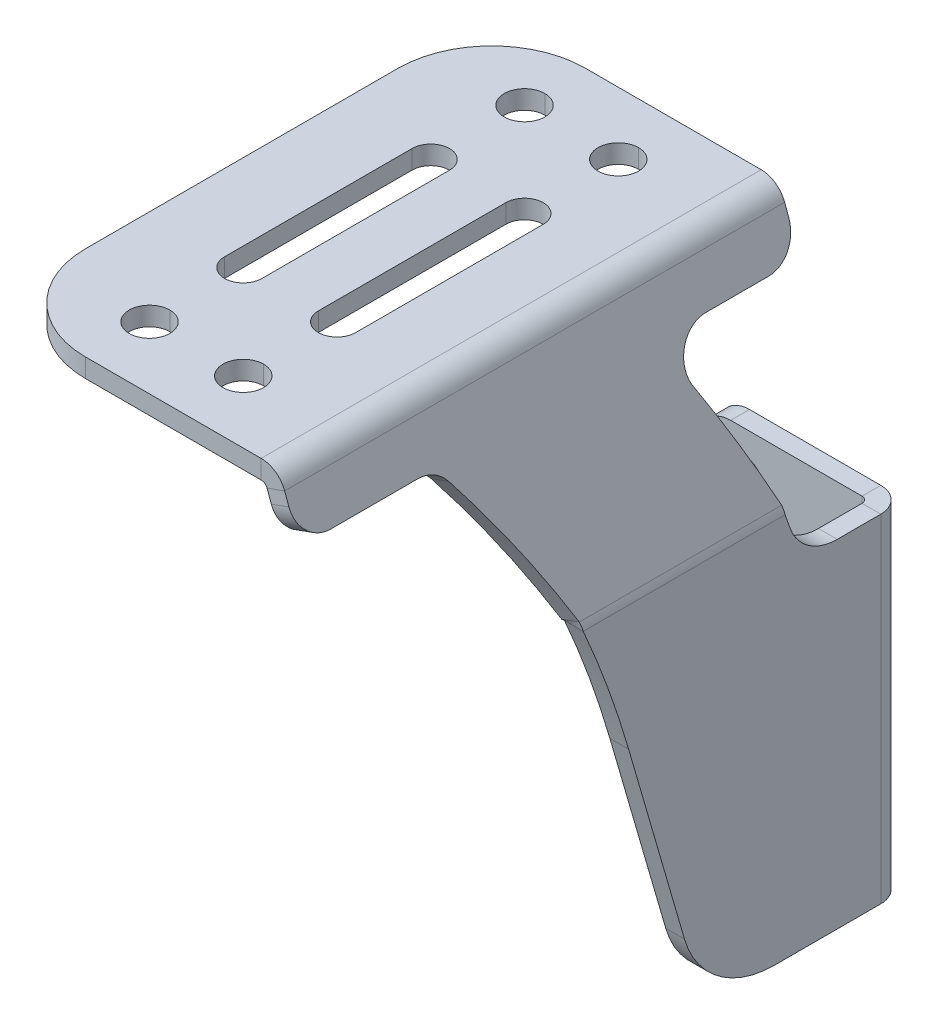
ISO-10303-21;
HEADER;
FILE_DESCRIPTION(('STEP AP214'),'2;1');
FILE_NAME('part.step','',(''),(''),'','','');
FILE_SCHEMA(('AUTOMOTIVE_DESIGN { 1 0 10303 214 1 1 1 1 }'));
ENDSEC;
DATA;
#1=APPLICATION_CONTEXT('core data for automotive mechanical design processes');
#2=APPLICATION_PROTOCOL_DEFINITION('international standard','automotive_design',2000,#1);
#3=PRODUCT_CONTEXT('',#1,'mechanical');
#4=PRODUCT('Part','Part','',(#3));
#5=PRODUCT_RELATED_PRODUCT_CATEGORY('part','',(#4));
#6=PRODUCT_DEFINITION_FORMATION('','',#4);
#7=PRODUCT_DEFINITION_CONTEXT('part definition',#1,'design');
#8=PRODUCT_DEFINITION('design','',#6,#7);
#9=PRODUCT_DEFINITION_SHAPE('','',#8);
#10=(LENGTH_UNIT() NAMED_UNIT(*) SI_UNIT(.MILLI.,.METRE.));
#11=(NAMED_UNIT(*) PLANE_ANGLE_UNIT() SI_UNIT($,.RADIAN.));
#12=(NAMED_UNIT(*) SI_UNIT($,.STERADIAN.) SOLID_ANGLE_UNIT());
#13=UNCERTAINTY_MEASURE_WITH_UNIT(LENGTH_MEASURE(1.E-05),#10,'distance_accuracy_value','');
#14=(GEOMETRIC_REPRESENTATION_CONTEXT(3) GLOBAL_UNCERTAINTY_ASSIGNED_CONTEXT((#13)) GLOBAL_UNIT_ASSIGNED_CONTEXT((#10,
#11,#12)) REPRESENTATION_CONTEXT('',''));
#15=CARTESIAN_POINT('',(0.,0.,0.));
#16=DIRECTION('',(0.,0.,1.));
#17=DIRECTION('',(1.,0.,0.));
#18=AXIS2_PLACEMENT_3D('',#15,#16,#17);
#19=CARTESIAN_POINT('',(43.,18.,3.));
#20=DIRECTION('',(0.,0.,1.));
#21=DIRECTION('',(1.,0.,0.));
#22=AXIS2_PLACEMENT_3D('',#19,#20,#21);
#23=CYLINDRICAL_SURFACE('',#22,5.);
#24=CARTESIAN_POINT('',(43.,18.,0.));
#25=DIRECTION('',(0.,0.,-1.));
#26=DIRECTION('',(1.,0.,0.));
#27=AXIS2_PLACEMENT_3D('',#24,#25,#26);
#28=CIRCLE('',#27,5.);
#29=CARTESIAN_POINT('',(43.,13.,0.));
#30=VERTEX_POINT('',#29);
#31=CARTESIAN_POINT('',(38.,18.,0.));
#32=VERTEX_POINT('',#31);
#33=EDGE_CURVE('E561',#30,#32,#28,.T.);
#34=ORIENTED_EDGE('',*,*,#33,.F.);
#35=DIRECTION('',(0.,0.,-1.));
#36=VECTOR('',#35,1.);
#37=CARTESIAN_POINT('',(43.,13.,-7.));
#38=LINE('',#37,#36);
#39=CARTESIAN_POINT('',(43.,13.,3.));
#40=VERTEX_POINT('',#39);
#41=EDGE_CURVE('E1222',#40,#30,#38,.T.);
#42=ORIENTED_EDGE('',*,*,#41,.F.);
#43=CARTESIAN_POINT('',(43.,18.,3.));
#44=DIRECTION('',(0.,0.,1.));
#45=DIRECTION('',(1.,0.,0.));
#46=AXIS2_PLACEMENT_3D('',#43,#44,#45);
#47=CIRCLE('',#46,5.);
#48=CARTESIAN_POINT('',(38.,18.,3.));
#49=VERTEX_POINT('',#48);
#50=EDGE_CURVE('E763',#49,#40,#47,.T.);
#51=ORIENTED_EDGE('',*,*,#50,.F.);
#52=DIRECTION('',(0.,0.,1.));
#53=VECTOR('',#52,1.);
#54=CARTESIAN_POINT('',(38.,18.,3.));
#55=LINE('',#54,#53);
#56=EDGE_CURVE('E594',#32,#49,#55,.T.);
#57=ORIENTED_EDGE('',*,*,#56,.F.);
#58=EDGE_LOOP('',(#34,#42,#51,#57));
#59=FACE_BOUND('',#58,.T.);
#60=ADVANCED_FACE('F17',(#59),#23,.T.);
#61=CARTESIAN_POINT('',(43.,-18.,3.));
#62=DIRECTION('',(0.,0.,-1.));
#63=DIRECTION('',(-1.,0.,0.));
#64=AXIS2_PLACEMENT_3D('',#61,#62,#63);
#65=CYLINDRICAL_SURFACE('',#64,5.);
#66=CARTESIAN_POINT('',(43.,-18.,3.));
#67=DIRECTION('',(0.,0.,1.));
#68=DIRECTION('',(1.,0.,0.));
#69=AXIS2_PLACEMENT_3D('',#66,#67,#68);
#70=CIRCLE('',#69,5.);
#71=CARTESIAN_POINT('',(43.,-13.,3.));
#72=VERTEX_POINT('',#71);
#73=CARTESIAN_POINT('',(38.,-18.,3.));
#74=VERTEX_POINT('',#73);
#75=EDGE_CURVE('E891',#72,#74,#70,.T.);
#76=ORIENTED_EDGE('',*,*,#75,.F.);
#77=DIRECTION('',(0.,0.,1.));
#78=VECTOR('',#77,1.);
#79=CARTESIAN_POINT('',(43.,-13.,-7.));
#80=LINE('',#79,#78);
#81=CARTESIAN_POINT('',(43.,-13.,0.));
#82=VERTEX_POINT('',#81);
#83=EDGE_CURVE('E11',#82,#72,#80,.T.);
#84=ORIENTED_EDGE('',*,*,#83,.F.);
#85=CARTESIAN_POINT('',(43.,-18.,0.));
#86=DIRECTION('',(0.,0.,-1.));
#87=DIRECTION('',(1.,0.,0.));
#88=AXIS2_PLACEMENT_3D('',#85,#86,#87);
#89=CIRCLE('',#88,5.);
#90=CARTESIAN_POINT('',(38.,-18.,0.));
#91=VERTEX_POINT('',#90);
#92=EDGE_CURVE('E647',#91,#82,#89,.T.);
#93=ORIENTED_EDGE('',*,*,#92,.F.);
#94=DIRECTION('',(0.,0.,-1.));
#95=VECTOR('',#94,1.);
#96=CARTESIAN_POINT('',(38.,-18.,3.));
#97=LINE('',#96,#95);
#98=EDGE_CURVE('E708',#74,#91,#97,.T.);
#99=ORIENTED_EDGE('',*,*,#98,.F.);
#100=EDGE_LOOP('',(#76,#84,#93,#99));
#101=FACE_BOUND('',#100,.T.);
#102=ADVANCED_FACE('F19',(#101),#65,.T.);
#103=CARTESIAN_POINT('',(51.,8.,-7.));
#104=DIRECTION('',(0.,0.,-1.));
#105=DIRECTION('',(-1.,0.,0.));
#106=AXIS2_PLACEMENT_3D('',#103,#104,#105);
#107=CYLINDRICAL_SURFACE('',#106,5.);
#108=CARTESIAN_POINT('',(51.,8.,0.));
#109=DIRECTION('',(0.,0.,1.));
#110=DIRECTION('',(1.,0.,0.));
#111=AXIS2_PLACEMENT_3D('',#108,#109,#110);
#112=CIRCLE('',#111,5.);
#113=CARTESIAN_POINT('',(56.,8.,0.));
#114=VERTEX_POINT('',#113);
#115=CARTESIAN_POINT('',(51.,13.,0.));
#116=VERTEX_POINT('',#115);
#117=EDGE_CURVE('E734',#114,#116,#112,.T.);
#118=ORIENTED_EDGE('',*,*,#117,.F.);
#119=DIRECTION('',(0.,0.,-1.));
#120=VECTOR('',#119,1.);
#121=CARTESIAN_POINT('',(56.,8.,0.));
#122=LINE('',#121,#120);
#123=CARTESIAN_POINT('',(56.,8.,3.));
#124=VERTEX_POINT('',#123);
#125=EDGE_CURVE('E397',#124,#114,#122,.T.);
#126=ORIENTED_EDGE('',*,*,#125,.F.);
#127=CARTESIAN_POINT('',(51.,8.,3.));
#128=DIRECTION('',(0.,0.,-1.));
#129=DIRECTION('',(1.,0.,0.));
#130=AXIS2_PLACEMENT_3D('',#127,#128,#129);
#131=CIRCLE('',#130,5.);
#132=CARTESIAN_POINT('',(51.,13.,3.));
#133=VERTEX_POINT('',#132);
#134=EDGE_CURVE('E827',#133,#124,#131,.T.);
#135=ORIENTED_EDGE('',*,*,#134,.F.);
#136=DIRECTION('',(0.,0.,1.));
#137=VECTOR('',#136,1.);
#138=CARTESIAN_POINT('',(51.,13.,3.));
#139=LINE('',#138,#137);
#140=EDGE_CURVE('E408',#116,#133,#139,.T.);
#141=ORIENTED_EDGE('',*,*,#140,.F.);
#142=EDGE_LOOP('',(#118,#126,#135,#141));
#143=FACE_BOUND('',#142,.T.);
#144=ADVANCED_FACE('F2351',(#143),#107,.F.);
#145=CARTESIAN_POINT('',(51.,-8.,-7.));
#146=DIRECTION('',(0.,0.,-1.));
#147=DIRECTION('',(-1.,0.,0.));
#148=AXIS2_PLACEMENT_3D('',#145,#146,#147);
#149=CYLINDRICAL_SURFACE('',#148,5.);
#150=CARTESIAN_POINT('',(51.,-8.,0.));
#151=DIRECTION('',(0.,0.,1.));
#152=DIRECTION('',(1.,0.,0.));
#153=AXIS2_PLACEMENT_3D('',#150,#151,#152);
#154=CIRCLE('',#153,5.);
#155=CARTESIAN_POINT('',(51.,-13.,0.));
#156=VERTEX_POINT('',#155);
#157=CARTESIAN_POINT('',(56.,-8.,0.));
#158=VERTEX_POINT('',#157);
#159=EDGE_CURVE('E743',#156,#158,#154,.T.);
#160=ORIENTED_EDGE('',*,*,#159,.F.);
#161=DIRECTION('',(0.,0.,-1.));
#162=VECTOR('',#161,1.);
#163=CARTESIAN_POINT('',(51.,-13.,0.));
#164=LINE('',#163,#162);
#165=CARTESIAN_POINT('',(51.,-13.,3.));
#166=VERTEX_POINT('',#165);
#167=EDGE_CURVE('E27',#166,#156,#164,.T.);
#168=ORIENTED_EDGE('',*,*,#167,.F.);
#169=CARTESIAN_POINT('',(51.,-8.,3.));
#170=DIRECTION('',(0.,0.,-1.));
#171=DIRECTION('',(1.,0.,0.));
#172=AXIS2_PLACEMENT_3D('',#169,#170,#171);
#173=CIRCLE('',#172,5.);
#174=CARTESIAN_POINT('',(56.,-8.,3.));
#175=VERTEX_POINT('',#174);
#176=EDGE_CURVE('E920',#175,#166,#173,.T.);
#177=ORIENTED_EDGE('',*,*,#176,.F.);
#178=DIRECTION('',(0.,0.,1.));
#179=VECTOR('',#178,1.);
#180=CARTESIAN_POINT('',(56.,-8.,3.));
#181=LINE('',#180,#179);
#182=EDGE_CURVE('E1214',#158,#175,#181,.T.);
#183=ORIENTED_EDGE('',*,*,#182,.F.);
#184=EDGE_LOOP('',(#160,#168,#177,#183));
#185=FACE_BOUND('',#184,.T.);
#186=ADVANCED_FACE('F2408',(#185),#149,.F.);
#187=CARTESIAN_POINT('',(38.,-13.,-7.));
#188=DIRECTION('',(0.,-1.,0.));
#189=DIRECTION('',(0.,0.,-1.));
#190=AXIS2_PLACEMENT_3D('',#187,#188,#189);
#191=PLANE('',#190);
#192=DIRECTION('',(1.,0.,0.));
#193=VECTOR('',#192,1.);
#194=CARTESIAN_POINT('',(38.,-13.,3.));
#195=LINE('',#194,#193);
#196=EDGE_CURVE('E638',#72,#166,#195,.T.);
#197=ORIENTED_EDGE('',*,*,#196,.T.);
#198=ORIENTED_EDGE('',*,*,#167,.T.);
#199=DIRECTION('',(1.,0.,0.));
#200=VECTOR('',#199,1.);
#201=CARTESIAN_POINT('',(0.,-13.,0.));
#202=LINE('',#201,#200);
#203=EDGE_CURVE('E651',#82,#156,#202,.T.);
#204=ORIENTED_EDGE('',*,*,#203,.F.);
#205=ORIENTED_EDGE('',*,*,#83,.T.);
#206=EDGE_LOOP('',(#197,#198,#204,#205));
#207=FACE_BOUND('',#206,.T.);
#208=ADVANCED_FACE('F2449',(#207),#191,.F.);
#209=CARTESIAN_POINT('',(38.,13.,-7.));
#210=DIRECTION('',(0.,1.,0.));
#211=DIRECTION('',(1.,0.,0.));
#212=AXIS2_PLACEMENT_3D('',#209,#210,#211);
#213=PLANE('',#212);
#214=DIRECTION('',(-1.,0.,0.));
#215=VECTOR('',#214,1.);
#216=CARTESIAN_POINT('',(0.,13.,0.));
#217=LINE('',#216,#215);
#218=EDGE_CURVE('E738',#116,#30,#217,.T.);
#219=ORIENTED_EDGE('',*,*,#218,.F.);
#220=ORIENTED_EDGE('',*,*,#140,.T.);
#221=DIRECTION('',(-1.,0.,0.));
#222=VECTOR('',#221,1.);
#223=CARTESIAN_POINT('',(38.,13.,3.));
#224=LINE('',#223,#222);
#225=EDGE_CURVE('E767',#133,#40,#224,.T.);
#226=ORIENTED_EDGE('',*,*,#225,.T.);
#227=ORIENTED_EDGE('',*,*,#41,.T.);
#228=EDGE_LOOP('',(#219,#220,#226,#227));
#229=FACE_BOUND('',#228,.T.);
#230=ADVANCED_FACE('F2412',(#229),#213,.F.);
#231=CARTESIAN_POINT('',(56.,13.,-7.));
#232=DIRECTION('',(1.,0.,0.));
#233=DIRECTION('',(0.,1.,0.));
#234=AXIS2_PLACEMENT_3D('',#231,#232,#233);
#235=PLANE('',#234);
#236=DIRECTION('',(0.,1.,0.));
#237=VECTOR('',#236,1.);
#238=CARTESIAN_POINT('',(56.,0.,0.));
#239=LINE('',#238,#237);
#240=EDGE_CURVE('E739',#158,#114,#239,.T.);
#241=ORIENTED_EDGE('',*,*,#240,.F.);
#242=ORIENTED_EDGE('',*,*,#182,.T.);
#243=DIRECTION('',(0.,1.,0.));
#244=VECTOR('',#243,1.);
#245=CARTESIAN_POINT('',(56.,13.,3.));
#246=LINE('',#245,#244);
#247=EDGE_CURVE('E830',#175,#124,#246,.T.);
#248=ORIENTED_EDGE('',*,*,#247,.T.);
#249=ORIENTED_EDGE('',*,*,#125,.T.);
#250=EDGE_LOOP('',(#241,#242,#248,#249));
#251=FACE_BOUND('',#250,.T.);
#252=ADVANCED_FACE('F2409',(#251),#235,.F.);
#253=CARTESIAN_POINT('',(43.,22.,3.));
#254=DIRECTION('',(0.,0.,-1.));
#255=DIRECTION('',(-1.,0.,0.));
#256=AXIS2_PLACEMENT_3D('',#253,#254,#255);
#257=CYLINDRICAL_SURFACE('',#256,5.);
#258=CARTESIAN_POINT('',(43.,22.,3.));
#259=DIRECTION('',(0.,0.,1.));
#260=DIRECTION('',(1.,0.,0.));
#261=AXIS2_PLACEMENT_3D('',#258,#259,#260);
#262=CIRCLE('',#261,5.);
#263=CARTESIAN_POINT('',(43.,27.,3.));
#264=VERTEX_POINT('',#263);
#265=CARTESIAN_POINT('',(38.,22.,3.));
#266=VERTEX_POINT('',#265);
#267=EDGE_CURVE('E768',#264,#266,#262,.T.);
#268=ORIENTED_EDGE('',*,*,#267,.F.);
#269=DIRECTION('',(0.,0.,1.));
#270=VECTOR('',#269,1.);
#271=CARTESIAN_POINT('',(43.,27.,3.));
#272=LINE('',#271,#270);
#273=CARTESIAN_POINT('',(43.,27.,0.));
#274=VERTEX_POINT('',#273);
#275=EDGE_CURVE('E575',#274,#264,#272,.T.);
#276=ORIENTED_EDGE('',*,*,#275,.F.);
#277=CARTESIAN_POINT('',(43.,22.,0.));
#278=DIRECTION('',(0.,0.,-1.));
#279=DIRECTION('',(1.,0.,0.));
#280=AXIS2_PLACEMENT_3D('',#277,#278,#279);
#281=CIRCLE('',#280,5.);
#282=CARTESIAN_POINT('',(38.,22.,0.));
#283=VERTEX_POINT('',#282);
#284=EDGE_CURVE('E569',#283,#274,#281,.T.);
#285=ORIENTED_EDGE('',*,*,#284,.F.);
#286=DIRECTION('',(0.,0.,-1.));
#287=VECTOR('',#286,1.);
#288=CARTESIAN_POINT('',(38.,22.,3.));
#289=LINE('',#288,#287);
#290=EDGE_CURVE('E572',#266,#283,#289,.T.);
#291=ORIENTED_EDGE('',*,*,#290,.F.);
#292=EDGE_LOOP('',(#268,#276,#285,#291));
#293=FACE_BOUND('',#292,.T.);
#294=ADVANCED_FACE('F571',(#293),#257,.T.);
#295=CARTESIAN_POINT('',(43.,-22.,3.));
#296=DIRECTION('',(0.,0.,-1.));
#297=DIRECTION('',(-1.,0.,0.));
#298=AXIS2_PLACEMENT_3D('',#295,#296,#297);
#299=CYLINDRICAL_SURFACE('',#298,5.);
#300=CARTESIAN_POINT('',(43.,-22.,3.));
#301=DIRECTION('',(0.,0.,1.));
#302=DIRECTION('',(1.,0.,0.));
#303=AXIS2_PLACEMENT_3D('',#300,#301,#302);
#304=CIRCLE('',#303,5.);
#305=CARTESIAN_POINT('',(38.,-22.,3.));
#306=VERTEX_POINT('',#305);
#307=CARTESIAN_POINT('',(43.,-27.,3.));
#308=VERTEX_POINT('',#307);
#309=EDGE_CURVE('E904',#306,#308,#304,.T.);
#310=ORIENTED_EDGE('',*,*,#309,.F.);
#311=DIRECTION('',(0.,0.,1.));
#312=VECTOR('',#311,1.);
#313=CARTESIAN_POINT('',(38.,-22.,3.));
#314=LINE('',#313,#312);
#315=CARTESIAN_POINT('',(38.,-22.,0.));
#316=VERTEX_POINT('',#315);
#317=EDGE_CURVE('E701',#316,#306,#314,.T.);
#318=ORIENTED_EDGE('',*,*,#317,.F.);
#319=CARTESIAN_POINT('',(43.,-22.,0.));
#320=DIRECTION('',(0.,0.,-1.));
#321=DIRECTION('',(1.,0.,0.));
#322=AXIS2_PLACEMENT_3D('',#319,#320,#321);
#323=CIRCLE('',#322,5.);
#324=CARTESIAN_POINT('',(43.,-27.,0.));
#325=VERTEX_POINT('',#324);
#326=EDGE_CURVE('E691',#325,#316,#323,.T.);
#327=ORIENTED_EDGE('',*,*,#326,.F.);
#328=DIRECTION('',(0.,0.,-1.));
#329=VECTOR('',#328,1.);
#330=CARTESIAN_POINT('',(43.,-27.,3.));
#331=LINE('',#330,#329);
#332=EDGE_CURVE('E861',#308,#325,#331,.T.);
#333=ORIENTED_EDGE('',*,*,#332,.F.);
#334=EDGE_LOOP('',(#310,#318,#327,#333));
#335=FACE_BOUND('',#334,.T.);
#336=ADVANCED_FACE('F1436',(#335),#299,.T.);
#337=CARTESIAN_POINT('',(24.7605149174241,69.1635059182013,73.));
#338=DIRECTION('',(0.,-1.,0.));
#339=DIRECTION('',(1.,0.,0.));
#340=AXIS2_PLACEMENT_3D('',#337,#338,#339);
#341=CYLINDRICAL_SURFACE('',#340,15.);
#342=CARTESIAN_POINT('',(24.7605149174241,69.1635059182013,73.));
#343=DIRECTION('',(0.,1.,0.));
#344=DIRECTION('',(1.,0.,0.));
#345=AXIS2_PLACEMENT_3D('',#342,#343,#344);
#346=CIRCLE('',#345,15.);
#347=CARTESIAN_POINT('',(9.76051491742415,69.1635059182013,73.));
#348=VERTEX_POINT('',#347);
#349=CARTESIAN_POINT('',(24.7605149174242,69.1635059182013,88.));
#350=VERTEX_POINT('',#349);
#351=EDGE_CURVE('E1129',#348,#350,#346,.T.);
#352=ORIENTED_EDGE('',*,*,#351,.F.);
#353=DIRECTION('',(0.,1.,0.));
#354=VECTOR('',#353,1.);
#355=CARTESIAN_POINT('',(9.76051491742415,69.1635059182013,73.));
#356=LINE('',#355,#354);
#357=CARTESIAN_POINT('',(9.76051491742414,66.1635059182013,73.));
#358=VERTEX_POINT('',#357);
#359=EDGE_CURVE('E1191',#358,#348,#356,.T.);
#360=ORIENTED_EDGE('',*,*,#359,.F.);
#361=CARTESIAN_POINT('',(24.7605149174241,66.1635059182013,73.));
#362=DIRECTION('',(0.,-1.,0.));
#363=DIRECTION('',(1.,0.,0.));
#364=AXIS2_PLACEMENT_3D('',#361,#362,#363);
#365=CIRCLE('',#364,15.);
#366=CARTESIAN_POINT('',(24.7605149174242,66.1635059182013,88.));
#367=VERTEX_POINT('',#366);
#368=EDGE_CURVE('E665',#367,#358,#365,.T.);
#369=ORIENTED_EDGE('',*,*,#368,.F.);
#370=DIRECTION('',(0.,-1.,0.));
#371=VECTOR('',#370,1.);
#372=CARTESIAN_POINT('',(24.7605149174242,69.1635059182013,88.));
#373=LINE('',#372,#371);
#374=EDGE_CURVE('E1114',#350,#367,#373,.T.);
#375=ORIENTED_EDGE('',*,*,#374,.F.);
#376=EDGE_LOOP('',(#352,#360,#369,#375));
#377=FACE_BOUND('',#376,.T.);
#378=ADVANCED_FACE('F2303',(#377),#341,.T.);
#379=CARTESIAN_POINT('',(24.760514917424,69.1635059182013,23.));
#380=DIRECTION('',(0.,-1.,0.));
#381=DIRECTION('',(1.,0.,0.));
#382=AXIS2_PLACEMENT_3D('',#379,#380,#381);
#383=CYLINDRICAL_SURFACE('',#382,15.);
#384=CARTESIAN_POINT('',(24.760514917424,69.1635059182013,23.));
#385=DIRECTION('',(0.,1.,0.));
#386=DIRECTION('',(1.,0.,0.));
#387=AXIS2_PLACEMENT_3D('',#384,#385,#386);
#388=CIRCLE('',#387,15.);
#389=CARTESIAN_POINT('',(24.7605149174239,69.1635059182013,8.00000000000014));
#390=VERTEX_POINT('',#389);
#391=CARTESIAN_POINT('',(9.76051491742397,69.1635059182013,23.));
#392=VERTEX_POINT('',#391);
#393=EDGE_CURVE('E1121',#390,#392,#388,.T.);
#394=ORIENTED_EDGE('',*,*,#393,.F.);
#395=DIRECTION('',(0.,1.,0.));
#396=VECTOR('',#395,1.);
#397=CARTESIAN_POINT('',(24.7605149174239,69.1635059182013,8.00000000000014));
#398=LINE('',#397,#396);
#399=CARTESIAN_POINT('',(24.7605149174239,66.1635059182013,8.00000000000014));
#400=VERTEX_POINT('',#399);
#401=EDGE_CURVE('E1100',#400,#390,#398,.T.);
#402=ORIENTED_EDGE('',*,*,#401,.F.);
#403=CARTESIAN_POINT('',(24.760514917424,66.1635059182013,23.));
#404=DIRECTION('',(0.,-1.,0.));
#405=DIRECTION('',(1.,0.,0.));
#406=AXIS2_PLACEMENT_3D('',#403,#404,#405);
#407=CIRCLE('',#406,15.);
#408=CARTESIAN_POINT('',(9.76051491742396,66.1635059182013,23.));
#409=VERTEX_POINT('',#408);
#410=EDGE_CURVE('E662',#409,#400,#407,.T.);
#411=ORIENTED_EDGE('',*,*,#410,.F.);
#412=DIRECTION('',(0.,-1.,0.));
#413=VECTOR('',#412,1.);
#414=CARTESIAN_POINT('',(9.76051491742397,69.1635059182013,23.));
#415=LINE('',#414,#413);
#416=EDGE_CURVE('E924',#392,#409,#415,.T.);
#417=ORIENTED_EDGE('',*,*,#416,.F.);
#418=EDGE_LOOP('',(#394,#402,#411,#417));
#419=FACE_BOUND('',#418,.T.);
#420=ADVANCED_FACE('F2285',(#419),#383,.T.);
#421=CARTESIAN_POINT('',(37.,59.1635059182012,33.));
#422=DIRECTION('',(-1.,0.,0.));
#423=DIRECTION('',(0.,0.,1.));
#424=AXIS2_PLACEMENT_3D('',#421,#422,#423);
#425=PLANE('',#424);
#426=DIRECTION('',(0.,0.,-1.));
#427=VECTOR('',#426,1.);
#428=CARTESIAN_POINT('',(37.,66.1635059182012,0.));
#429=LINE('',#428,#427);
#430=CARTESIAN_POINT('',(37.,66.1635059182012,63.));
#431=VERTEX_POINT('',#430);
#432=CARTESIAN_POINT('',(37.,66.1635059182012,33.));
#433=VERTEX_POINT('',#432);
#434=EDGE_CURVE('E685',#431,#433,#429,.T.);
#435=ORIENTED_EDGE('',*,*,#434,.T.);
#436=DIRECTION('',(0.,1.,0.));
#437=VECTOR('',#436,1.);
#438=CARTESIAN_POINT('',(37.,59.1635059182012,33.));
#439=LINE('',#438,#437);
#440=CARTESIAN_POINT('',(37.,69.1635059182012,33.));
#441=VERTEX_POINT('',#440);
#442=EDGE_CURVE('E1206',#433,#441,#439,.T.);
#443=ORIENTED_EDGE('',*,*,#442,.T.);
#444=DIRECTION('',(0.,0.,1.));
#445=VECTOR('',#444,1.);
#446=CARTESIAN_POINT('',(37.,69.1635059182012,33.));
#447=LINE('',#446,#445);
#448=CARTESIAN_POINT('',(37.,69.1635059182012,63.));
#449=VERTEX_POINT('',#448);
#450=EDGE_CURVE('E1132',#441,#449,#447,.T.);
#451=ORIENTED_EDGE('',*,*,#450,.T.);
#452=DIRECTION('',(0.,1.,0.));
#453=VECTOR('',#452,1.);
#454=CARTESIAN_POINT('',(37.,59.1635059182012,63.));
#455=LINE('',#454,#453);
#456=EDGE_CURVE('E1211',#431,#449,#455,.T.);
#457=ORIENTED_EDGE('',*,*,#456,.F.);
#458=EDGE_LOOP('',(#435,#443,#451,#457));
#459=FACE_BOUND('',#458,.T.);
#460=ADVANCED_FACE('F2435',(#459),#425,.F.);
#461=CARTESIAN_POINT('',(40.,59.1635059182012,63.));
#462=DIRECTION('',(0.,1.,0.));
#463=DIRECTION('',(-1.,0.,0.));
#464=AXIS2_PLACEMENT_3D('',#461,#462,#463);
#465=CYLINDRICAL_SURFACE('',#464,3.);
#466=CARTESIAN_POINT('',(40.,66.1635059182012,63.));
#467=DIRECTION('',(0.,-1.,0.));
#468=DIRECTION('',(1.,0.,0.));
#469=AXIS2_PLACEMENT_3D('',#466,#467,#468);
#470=CIRCLE('',#469,3.);
#471=CARTESIAN_POINT('',(43.,66.1635059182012,63.));
#472=VERTEX_POINT('',#471);
#473=EDGE_CURVE('E689',#472,#431,#470,.T.);
#474=ORIENTED_EDGE('',*,*,#473,.T.);
#475=ORIENTED_EDGE('',*,*,#456,.T.);
#476=CARTESIAN_POINT('',(40.,69.1635059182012,63.));
#477=DIRECTION('',(0.,1.,0.));
#478=DIRECTION('',(-1.,0.,0.));
#479=AXIS2_PLACEMENT_3D('',#476,#477,#478);
#480=CIRCLE('',#479,3.);
#481=CARTESIAN_POINT('',(43.,69.1635059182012,63.));
#482=VERTEX_POINT('',#481);
#483=EDGE_CURVE('E972',#449,#482,#480,.T.);
#484=ORIENTED_EDGE('',*,*,#483,.T.);
#485=DIRECTION('',(0.,1.,0.));
#486=VECTOR('',#485,1.);
#487=CARTESIAN_POINT('',(43.,59.1635059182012,63.));
#488=LINE('',#487,#486);
#489=EDGE_CURVE('E255',#472,#482,#488,.T.);
#490=ORIENTED_EDGE('',*,*,#489,.F.);
#491=EDGE_LOOP('',(#474,#475,#484,#490));
#492=FACE_BOUND('',#491,.T.);
#493=ADVANCED_FACE('F2433',(#492),#465,.F.);
#494=CARTESIAN_POINT('',(43.,59.1635059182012,33.));
#495=DIRECTION('',(1.,0.,0.));
#496=DIRECTION('',(0.,-1.,0.));
#497=AXIS2_PLACEMENT_3D('',#494,#495,#496);
#498=PLANE('',#497);
#499=DIRECTION('',(0.,0.,1.));
#500=VECTOR('',#499,1.);
#501=CARTESIAN_POINT('',(43.,66.1635059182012,0.));
#502=LINE('',#501,#500);
#503=CARTESIAN_POINT('',(43.,66.1635059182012,33.));
#504=VERTEX_POINT('',#503);
#505=EDGE_CURVE('E1169',#504,#472,#502,.T.);
#506=ORIENTED_EDGE('',*,*,#505,.T.);
#507=ORIENTED_EDGE('',*,*,#489,.T.);
#508=DIRECTION('',(0.,0.,-1.));
#509=VECTOR('',#508,1.);
#510=CARTESIAN_POINT('',(43.,69.1635059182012,33.));
#511=LINE('',#510,#509);
#512=CARTESIAN_POINT('',(43.,69.1635059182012,33.));
#513=VERTEX_POINT('',#512);
#514=EDGE_CURVE('E1011',#482,#513,#511,.T.);
#515=ORIENTED_EDGE('',*,*,#514,.T.);
#516=DIRECTION('',(0.,1.,0.));
#517=VECTOR('',#516,1.);
#518=CARTESIAN_POINT('',(43.,59.1635059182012,33.));
#519=LINE('',#518,#517);
#520=EDGE_CURVE('E1203',#504,#513,#519,.T.);
#521=ORIENTED_EDGE('',*,*,#520,.F.);
#522=EDGE_LOOP('',(#506,#507,#515,#521));
#523=FACE_BOUND('',#522,.T.);
#524=ADVANCED_FACE('F2429',(#523),#498,.F.);
#525=CARTESIAN_POINT('',(40.,59.1635059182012,33.));
#526=DIRECTION('',(0.,1.,0.));
#527=DIRECTION('',(-1.,0.,0.));
#528=AXIS2_PLACEMENT_3D('',#525,#526,#527);
#529=CYLINDRICAL_SURFACE('',#528,3.);
#530=CARTESIAN_POINT('',(40.,66.1635059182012,33.));
#531=DIRECTION('',(0.,-1.,0.));
#532=DIRECTION('',(1.,0.,0.));
#533=AXIS2_PLACEMENT_3D('',#530,#531,#532);
#534=CIRCLE('',#533,3.);
#535=EDGE_CURVE('E690',#433,#504,#534,.T.);
#536=ORIENTED_EDGE('',*,*,#535,.T.);
#537=ORIENTED_EDGE('',*,*,#520,.T.);
#538=CARTESIAN_POINT('',(40.,69.1635059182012,33.));
#539=DIRECTION('',(0.,1.,0.));
#540=DIRECTION('',(-1.,0.,0.));
#541=AXIS2_PLACEMENT_3D('',#538,#539,#540);
#542=CIRCLE('',#541,3.);
#543=EDGE_CURVE('E1015',#513,#441,#542,.T.);
#544=ORIENTED_EDGE('',*,*,#543,.T.);
#545=ORIENTED_EDGE('',*,*,#442,.F.);
#546=EDGE_LOOP('',(#536,#537,#544,#545));
#547=FACE_BOUND('',#546,.T.);
#548=ADVANCED_FACE('F2390',(#547),#529,.F.);
#549=CARTESIAN_POINT('',(22.0000000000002,59.1635059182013,33.));
#550=DIRECTION('',(-1.,0.,0.));
#551=DIRECTION('',(0.,0.,1.));
#552=AXIS2_PLACEMENT_3D('',#549,#550,#551);
#553=PLANE('',#552);
#554=DIRECTION('',(0.,0.,-1.));
#555=VECTOR('',#554,1.);
#556=CARTESIAN_POINT('',(22.0000000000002,66.1635059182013,0.));
#557=LINE('',#556,#555);
#558=CARTESIAN_POINT('',(22.0000000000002,66.1635059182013,63.));
#559=VERTEX_POINT('',#558);
#560=CARTESIAN_POINT('',(22.0000000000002,66.1635059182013,33.));
#561=VERTEX_POINT('',#560);
#562=EDGE_CURVE('E726',#559,#561,#557,.T.);
#563=ORIENTED_EDGE('',*,*,#562,.T.);
#564=DIRECTION('',(0.,1.,0.));
#565=VECTOR('',#564,1.);
#566=CARTESIAN_POINT('',(22.0000000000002,59.1635059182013,33.));
#567=LINE('',#566,#565);
#568=CARTESIAN_POINT('',(22.0000000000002,69.1635059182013,33.));
#569=VERTEX_POINT('',#568);
#570=EDGE_CURVE('E244',#561,#569,#567,.T.);
#571=ORIENTED_EDGE('',*,*,#570,.T.);
#572=DIRECTION('',(0.,0.,1.));
#573=VECTOR('',#572,1.);
#574=CARTESIAN_POINT('',(22.0000000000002,69.1635059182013,33.));
#575=LINE('',#574,#573);
#576=CARTESIAN_POINT('',(22.0000000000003,69.1635059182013,63.));
#577=VERTEX_POINT('',#576);
#578=EDGE_CURVE('E968',#569,#577,#575,.T.);
#579=ORIENTED_EDGE('',*,*,#578,.T.);
#580=DIRECTION('',(0.,1.,0.));
#581=VECTOR('',#580,1.);
#582=CARTESIAN_POINT('',(22.0000000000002,59.1635059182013,63.));
#583=LINE('',#582,#581);
#584=EDGE_CURVE('E55',#559,#577,#583,.T.);
#585=ORIENTED_EDGE('',*,*,#584,.F.);
#586=EDGE_LOOP('',(#563,#571,#579,#585));
#587=FACE_BOUND('',#586,.T.);
#588=ADVANCED_FACE('F2262',(#587),#553,.F.);
#589=CARTESIAN_POINT('',(25.,59.1635059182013,63.));
#590=DIRECTION('',(0.,1.,0.));
#591=DIRECTION('',(-1.,0.,0.));
#592=AXIS2_PLACEMENT_3D('',#589,#590,#591);
#593=CYLINDRICAL_SURFACE('',#592,3.);
#594=CARTESIAN_POINT('',(25.,66.1635059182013,63.));
#595=DIRECTION('',(0.,-1.,0.));
#596=DIRECTION('',(1.,0.,0.));
#597=AXIS2_PLACEMENT_3D('',#594,#595,#596);
#598=CIRCLE('',#597,3.);
#599=CARTESIAN_POINT('',(28.,66.1635059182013,63.));
#600=VERTEX_POINT('',#599);
#601=EDGE_CURVE('E729',#600,#559,#598,.T.);
#602=ORIENTED_EDGE('',*,*,#601,.T.);
#603=ORIENTED_EDGE('',*,*,#584,.T.);
#604=CARTESIAN_POINT('',(25.,69.1635059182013,63.));
#605=DIRECTION('',(0.,1.,0.));
#606=DIRECTION('',(-1.,0.,0.));
#607=AXIS2_PLACEMENT_3D('',#604,#605,#606);
#608=CIRCLE('',#607,3.);
#609=CARTESIAN_POINT('',(28.,69.1635059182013,63.));
#610=VERTEX_POINT('',#609);
#611=EDGE_CURVE('E1147',#577,#610,#608,.T.);
#612=ORIENTED_EDGE('',*,*,#611,.T.);
#613=DIRECTION('',(0.,1.,0.));
#614=VECTOR('',#613,1.);
#615=CARTESIAN_POINT('',(28.,59.1635059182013,63.));
#616=LINE('',#615,#614);
#617=EDGE_CURVE('E41',#600,#610,#616,.T.);
#618=ORIENTED_EDGE('',*,*,#617,.F.);
#619=EDGE_LOOP('',(#602,#603,#612,#618));
#620=FACE_BOUND('',#619,.T.);
#621=ADVANCED_FACE('F2253',(#620),#593,.F.);
#622=CARTESIAN_POINT('',(28.,59.1635059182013,33.));
#623=DIRECTION('',(1.,0.,0.));
#624=DIRECTION('',(0.,-1.,0.));
#625=AXIS2_PLACEMENT_3D('',#622,#623,#624);
#626=PLANE('',#625);
#627=DIRECTION('',(0.,0.,1.));
#628=VECTOR('',#627,1.);
#629=CARTESIAN_POINT('',(28.,66.1635059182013,0.));
#630=LINE('',#629,#628);
#631=CARTESIAN_POINT('',(28.,66.1635059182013,33.));
#632=VERTEX_POINT('',#631);
#633=EDGE_CURVE('E1176',#632,#600,#630,.T.);
#634=ORIENTED_EDGE('',*,*,#633,.T.);
#635=ORIENTED_EDGE('',*,*,#617,.T.);
#636=DIRECTION('',(0.,0.,-1.));
#637=VECTOR('',#636,1.);
#638=CARTESIAN_POINT('',(28.,69.1635059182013,33.));
#639=LINE('',#638,#637);
#640=CARTESIAN_POINT('',(28.,69.1635059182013,33.));
#641=VERTEX_POINT('',#640);
#642=EDGE_CURVE('E1143',#610,#641,#639,.T.);
#643=ORIENTED_EDGE('',*,*,#642,.T.);
#644=DIRECTION('',(0.,1.,0.));
#645=VECTOR('',#644,1.);
#646=CARTESIAN_POINT('',(28.,59.1635059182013,33.));
#647=LINE('',#646,#645);
#648=EDGE_CURVE('E1194',#632,#641,#647,.T.);
#649=ORIENTED_EDGE('',*,*,#648,.F.);
#650=EDGE_LOOP('',(#634,#635,#643,#649));
#651=FACE_BOUND('',#650,.T.);
#652=ADVANCED_FACE('F2267',(#651),#626,.F.);
#653=CARTESIAN_POINT('',(25.,59.1635059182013,33.));
#654=DIRECTION('',(0.,1.,0.));
#655=DIRECTION('',(-1.,0.,0.));
#656=AXIS2_PLACEMENT_3D('',#653,#654,#655);
#657=CYLINDRICAL_SURFACE('',#656,3.);
#658=CARTESIAN_POINT('',(25.,66.1635059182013,33.));
#659=DIRECTION('',(0.,-1.,0.));
#660=DIRECTION('',(1.,0.,0.));
#661=AXIS2_PLACEMENT_3D('',#658,#659,#660);
#662=CIRCLE('',#661,3.);
#663=EDGE_CURVE('E730',#561,#632,#662,.T.);
#664=ORIENTED_EDGE('',*,*,#663,.T.);
#665=ORIENTED_EDGE('',*,*,#648,.T.);
#666=CARTESIAN_POINT('',(25.,69.1635059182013,33.));
#667=DIRECTION('',(0.,1.,0.));
#668=DIRECTION('',(-1.,0.,0.));
#669=AXIS2_PLACEMENT_3D('',#666,#667,#668);
#670=CIRCLE('',#669,3.);
#671=EDGE_CURVE('E971',#641,#569,#670,.T.);
#672=ORIENTED_EDGE('',*,*,#671,.T.);
#673=ORIENTED_EDGE('',*,*,#570,.F.);
#674=EDGE_LOOP('',(#664,#665,#672,#673));
#675=FACE_BOUND('',#674,.T.);
#676=ADVANCED_FACE('F2264',(#675),#657,.F.);
#677=CARTESIAN_POINT('',(40.,69.1635059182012,18.));
#678=DIRECTION('',(0.,1.,0.));
#679=DIRECTION('',(0.,0.,1.));
#680=AXIS2_PLACEMENT_3D('',#677,#678,#679);
#681=CYLINDRICAL_SURFACE('',#680,3.25);
#682=DIRECTION('',(0.,1.,0.));
#683=VECTOR('',#682,1.);
#684=CARTESIAN_POINT('',(40.,69.1635059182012,14.75));
#685=LINE('',#684,#683);
#686=CARTESIAN_POINT('',(40.,66.1635059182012,14.75));
#687=VERTEX_POINT('',#686);
#688=CARTESIAN_POINT('',(40.,69.1635059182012,14.75));
#689=VERTEX_POINT('',#688);
#690=EDGE_CURVE('E614',#687,#689,#685,.T.);
#691=ORIENTED_EDGE('',*,*,#690,.F.);
#692=CARTESIAN_POINT('',(40.,66.1635059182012,18.));
#693=DIRECTION('',(0.,-1.,0.));
#694=DIRECTION('',(1.,0.,0.));
#695=AXIS2_PLACEMENT_3D('',#692,#693,#694);
#696=CIRCLE('',#695,3.25);
#697=CARTESIAN_POINT('',(40.,66.1635059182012,21.25));
#698=VERTEX_POINT('',#697);
#699=EDGE_CURVE('E1179',#687,#698,#696,.T.);
#700=ORIENTED_EDGE('',*,*,#699,.T.);
#701=DIRECTION('',(0.,1.,0.));
#702=VECTOR('',#701,1.);
#703=CARTESIAN_POINT('',(40.,69.1635059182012,21.25));
#704=LINE('',#703,#702);
#705=CARTESIAN_POINT('',(40.,69.1635059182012,21.25));
#706=VERTEX_POINT('',#705);
#707=EDGE_CURVE('E613',#698,#706,#704,.T.);
#708=ORIENTED_EDGE('',*,*,#707,.T.);
#709=CARTESIAN_POINT('',(40.,69.1635059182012,18.));
#710=DIRECTION('',(0.,1.,0.));
#711=DIRECTION('',(0.,0.,1.));
#712=AXIS2_PLACEMENT_3D('',#709,#710,#711);
#713=CIRCLE('',#712,3.25);
#714=EDGE_CURVE('E1150',#706,#689,#713,.T.);
#715=ORIENTED_EDGE('',*,*,#714,.T.);
#716=EDGE_LOOP('',(#691,#700,#708,#715));
#717=FACE_BOUND('',#716,.T.);
#718=ADVANCED_FACE('F2419',(#717),#681,.F.);
#719=CARTESIAN_POINT('',(40.,69.1635059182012,78.));
#720=DIRECTION('',(0.,1.,0.));
#721=DIRECTION('',(0.,0.,1.));
#722=AXIS2_PLACEMENT_3D('',#719,#720,#721);
#723=CYLINDRICAL_SURFACE('',#722,3.25);
#724=DIRECTION('',(0.,1.,0.));
#725=VECTOR('',#724,1.);
#726=CARTESIAN_POINT('',(40.,69.1635059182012,74.75));
#727=LINE('',#726,#725);
#728=CARTESIAN_POINT('',(40.,66.1635059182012,74.75));
#729=VERTEX_POINT('',#728);
#730=CARTESIAN_POINT('',(40.,69.1635059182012,74.75));
#731=VERTEX_POINT('',#730);
#732=EDGE_CURVE('E629',#729,#731,#727,.T.);
#733=ORIENTED_EDGE('',*,*,#732,.F.);
#734=CARTESIAN_POINT('',(40.,66.1635059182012,78.));
#735=DIRECTION('',(0.,-1.,0.));
#736=DIRECTION('',(1.,0.,0.));
#737=AXIS2_PLACEMENT_3D('',#734,#735,#736);
#738=CIRCLE('',#737,3.25);
#739=CARTESIAN_POINT('',(40.,66.1635059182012,81.25));
#740=VERTEX_POINT('',#739);
#741=EDGE_CURVE('E1183',#729,#740,#738,.T.);
#742=ORIENTED_EDGE('',*,*,#741,.T.);
#743=DIRECTION('',(0.,1.,0.));
#744=VECTOR('',#743,1.);
#745=CARTESIAN_POINT('',(40.,69.1635059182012,81.25));
#746=LINE('',#745,#744);
#747=CARTESIAN_POINT('',(40.,69.1635059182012,81.25));
#748=VERTEX_POINT('',#747);
#749=EDGE_CURVE('E628',#740,#748,#746,.T.);
#750=ORIENTED_EDGE('',*,*,#749,.T.);
#751=CARTESIAN_POINT('',(40.,69.1635059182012,78.));
#752=DIRECTION('',(0.,1.,0.));
#753=DIRECTION('',(0.,0.,1.));
#754=AXIS2_PLACEMENT_3D('',#751,#752,#753);
#755=CIRCLE('',#754,3.25);
#756=EDGE_CURVE('E1153',#748,#731,#755,.T.);
#757=ORIENTED_EDGE('',*,*,#756,.T.);
#758=EDGE_LOOP('',(#733,#742,#750,#757));
#759=FACE_BOUND('',#758,.T.);
#760=ADVANCED_FACE('F2415',(#759),#723,.F.);
#761=CARTESIAN_POINT('',(25.0000000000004,69.1635059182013,18.));
#762=DIRECTION('',(0.,1.,0.));
#763=DIRECTION('',(0.,0.,1.));
#764=AXIS2_PLACEMENT_3D('',#761,#762,#763);
#765=CYLINDRICAL_SURFACE('',#764,3.25);
#766=DIRECTION('',(0.,1.,0.));
#767=VECTOR('',#766,1.);
#768=CARTESIAN_POINT('',(25.0000000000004,69.1635059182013,14.75));
#769=LINE('',#768,#767);
#770=CARTESIAN_POINT('',(25.0000000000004,66.1635059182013,14.75));
#771=VERTEX_POINT('',#770);
#772=CARTESIAN_POINT('',(25.0000000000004,69.1635059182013,14.75));
#773=VERTEX_POINT('',#772);
#774=EDGE_CURVE('E678',#771,#773,#769,.T.);
#775=ORIENTED_EDGE('',*,*,#774,.F.);
#776=CARTESIAN_POINT('',(25.0000000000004,66.1635059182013,18.));
#777=DIRECTION('',(0.,-1.,0.));
#778=DIRECTION('',(1.,0.,0.));
#779=AXIS2_PLACEMENT_3D('',#776,#777,#778);
#780=CIRCLE('',#779,3.25);
#781=CARTESIAN_POINT('',(25.0000000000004,66.1635059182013,21.25));
#782=VERTEX_POINT('',#781);
#783=EDGE_CURVE('E925',#771,#782,#780,.T.);
#784=ORIENTED_EDGE('',*,*,#783,.T.);
#785=DIRECTION('',(0.,1.,0.));
#786=VECTOR('',#785,1.);
#787=CARTESIAN_POINT('',(25.0000000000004,69.1635059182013,21.25));
#788=LINE('',#787,#786);
#789=CARTESIAN_POINT('',(25.0000000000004,69.1635059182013,21.25));
#790=VERTEX_POINT('',#789);
#791=EDGE_CURVE('E712',#782,#790,#788,.T.);
#792=ORIENTED_EDGE('',*,*,#791,.T.);
#793=CARTESIAN_POINT('',(25.0000000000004,69.1635059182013,18.));
#794=DIRECTION('',(0.,1.,0.));
#795=DIRECTION('',(0.,0.,1.));
#796=AXIS2_PLACEMENT_3D('',#793,#794,#795);
#797=CIRCLE('',#796,3.25);
#798=EDGE_CURVE('E952',#790,#773,#797,.T.);
#799=ORIENTED_EDGE('',*,*,#798,.T.);
#800=EDGE_LOOP('',(#775,#784,#792,#799));
#801=FACE_BOUND('',#800,.T.);
#802=ADVANCED_FACE('F2404',(#801),#765,.F.);
#803=CARTESIAN_POINT('',(25.0000000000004,69.1635059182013,78.));
#804=DIRECTION('',(0.,1.,0.));
#805=DIRECTION('',(0.,0.,1.));
#806=AXIS2_PLACEMENT_3D('',#803,#804,#805);
#807=CYLINDRICAL_SURFACE('',#806,3.25);
#808=DIRECTION('',(0.,1.,0.));
#809=VECTOR('',#808,1.);
#810=CARTESIAN_POINT('',(25.0000000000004,69.1635059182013,74.75));
#811=LINE('',#810,#809);
#812=CARTESIAN_POINT('',(25.0000000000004,66.1635059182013,74.75));
#813=VERTEX_POINT('',#812);
#814=CARTESIAN_POINT('',(25.0000000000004,69.1635059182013,74.75));
#815=VERTEX_POINT('',#814);
#816=EDGE_CURVE('E623',#813,#815,#811,.T.);
#817=ORIENTED_EDGE('',*,*,#816,.F.);
#818=CARTESIAN_POINT('',(25.0000000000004,66.1635059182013,78.));
#819=DIRECTION('',(0.,-1.,0.));
#820=DIRECTION('',(1.,0.,0.));
#821=AXIS2_PLACEMENT_3D('',#818,#819,#820);
#822=CIRCLE('',#821,3.25);
#823=CARTESIAN_POINT('',(25.0000000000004,66.1635059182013,81.25));
#824=VERTEX_POINT('',#823);
#825=EDGE_CURVE('E921',#813,#824,#822,.T.);
#826=ORIENTED_EDGE('',*,*,#825,.T.);
#827=DIRECTION('',(0.,1.,0.));
#828=VECTOR('',#827,1.);
#829=CARTESIAN_POINT('',(25.0000000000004,69.1635059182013,81.25));
#830=LINE('',#829,#828);
#831=CARTESIAN_POINT('',(25.0000000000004,69.1635059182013,81.25));
#832=VERTEX_POINT('',#831);
#833=EDGE_CURVE('E622',#824,#832,#830,.T.);
#834=ORIENTED_EDGE('',*,*,#833,.T.);
#835=CARTESIAN_POINT('',(25.0000000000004,69.1635059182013,78.));
#836=DIRECTION('',(0.,1.,0.));
#837=DIRECTION('',(0.,0.,1.));
#838=AXIS2_PLACEMENT_3D('',#835,#836,#837);
#839=CIRCLE('',#838,3.25);
#840=EDGE_CURVE('E949',#832,#815,#839,.T.);
#841=ORIENTED_EDGE('',*,*,#840,.T.);
#842=EDGE_LOOP('',(#817,#826,#834,#841));
#843=FACE_BOUND('',#842,.T.);
#844=ADVANCED_FACE('F2364',(#843),#807,.F.);
#845=CARTESIAN_POINT('',(45.,20.,3.));
#846=DIRECTION('',(0.,0.,1.));
#847=DIRECTION('',(1.,0.,0.));
#848=AXIS2_PLACEMENT_3D('',#845,#846,#847);
#849=CYLINDRICAL_SURFACE('',#848,3.25);
#850=DIRECTION('',(0.,0.,1.));
#851=VECTOR('',#850,1.);
#852=CARTESIAN_POINT('',(41.75,20.,3.));
#853=LINE('',#852,#851);
#854=CARTESIAN_POINT('',(41.75,20.,0.));
#855=VERTEX_POINT('',#854);
#856=CARTESIAN_POINT('',(41.75,20.,3.));
#857=VERTEX_POINT('',#856);
#858=EDGE_CURVE('E758',#855,#857,#853,.T.);
#859=ORIENTED_EDGE('',*,*,#858,.F.);
#860=CARTESIAN_POINT('',(45.,20.,0.));
#861=DIRECTION('',(0.,0.,1.));
#862=DIRECTION('',(1.,0.,0.));
#863=AXIS2_PLACEMENT_3D('',#860,#861,#862);
#864=CIRCLE('',#863,3.25);
#865=CARTESIAN_POINT('',(48.25,20.,0.));
#866=VERTEX_POINT('',#865);
#867=EDGE_CURVE('E695',#866,#855,#864,.T.);
#868=ORIENTED_EDGE('',*,*,#867,.F.);
#869=DIRECTION('',(0.,0.,1.));
#870=VECTOR('',#869,1.);
#871=CARTESIAN_POINT('',(48.25,20.,3.));
#872=LINE('',#871,#870);
#873=CARTESIAN_POINT('',(48.25,20.,3.));
#874=VERTEX_POINT('',#873);
#875=EDGE_CURVE('E772',#866,#874,#872,.T.);
#876=ORIENTED_EDGE('',*,*,#875,.T.);
#877=CARTESIAN_POINT('',(45.,20.,3.));
#878=DIRECTION('',(0.,0.,1.));
#879=DIRECTION('',(1.,0.,0.));
#880=AXIS2_PLACEMENT_3D('',#877,#878,#879);
#881=CIRCLE('',#880,3.25);
#882=EDGE_CURVE('E929',#874,#857,#881,.T.);
#883=ORIENTED_EDGE('',*,*,#882,.T.);
#884=EDGE_LOOP('',(#859,#868,#876,#883));
#885=FACE_BOUND('',#884,.T.);
#886=ADVANCED_FACE('F2360',(#885),#849,.F.);
#887=CARTESIAN_POINT('',(45.,-20.,3.));
#888=DIRECTION('',(0.,0.,1.));
#889=DIRECTION('',(1.,0.,0.));
#890=AXIS2_PLACEMENT_3D('',#887,#888,#889);
#891=CYLINDRICAL_SURFACE('',#890,3.25);
#892=DIRECTION('',(0.,0.,1.));
#893=VECTOR('',#892,1.);
#894=CARTESIAN_POINT('',(41.75,-20.,3.));
#895=LINE('',#894,#893);
#896=CARTESIAN_POINT('',(41.75,-20.,0.));
#897=VERTEX_POINT('',#896);
#898=CARTESIAN_POINT('',(41.75,-20.,3.));
#899=VERTEX_POINT('',#898);
#900=EDGE_CURVE('E748',#897,#899,#895,.T.);
#901=ORIENTED_EDGE('',*,*,#900,.F.);
#902=CARTESIAN_POINT('',(45.,-20.,0.));
#903=DIRECTION('',(0.,0.,1.));
#904=DIRECTION('',(1.,0.,0.));
#905=AXIS2_PLACEMENT_3D('',#902,#903,#904);
#906=CIRCLE('',#905,3.25);
#907=CARTESIAN_POINT('',(48.25,-20.,0.));
#908=VERTEX_POINT('',#907);
#909=EDGE_CURVE('E943',#908,#897,#906,.T.);
#910=ORIENTED_EDGE('',*,*,#909,.F.);
#911=DIRECTION('',(0.,0.,1.));
#912=VECTOR('',#911,1.);
#913=CARTESIAN_POINT('',(48.25,-20.,3.));
#914=LINE('',#913,#912);
#915=CARTESIAN_POINT('',(48.25,-20.,3.));
#916=VERTEX_POINT('',#915);
#917=EDGE_CURVE('E658',#908,#916,#914,.T.);
#918=ORIENTED_EDGE('',*,*,#917,.T.);
#919=CARTESIAN_POINT('',(45.,-20.,3.));
#920=DIRECTION('',(0.,0.,1.));
#921=DIRECTION('',(1.,0.,0.));
#922=AXIS2_PLACEMENT_3D('',#919,#920,#921);
#923=CIRCLE('',#922,3.25);
#924=EDGE_CURVE('E674',#916,#899,#923,.T.);
#925=ORIENTED_EDGE('',*,*,#924,.T.);
#926=EDGE_LOOP('',(#901,#910,#918,#925));
#927=FACE_BOUND('',#926,.T.);
#928=ADVANCED_FACE('F2363',(#927),#891,.F.);
#929=CARTESIAN_POINT('',(57.3053804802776,64.652201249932,83.));
#930=DIRECTION('',(-0.939692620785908,-0.342020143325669,0.));
#931=DIRECTION('',(0.342020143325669,-0.939692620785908,0.));
#932=AXIS2_PLACEMENT_3D('',#929,#930,#931);
#933=CYLINDRICAL_SURFACE('',#932,5.);
#934=CARTESIAN_POINT('',(57.3053804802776,64.652201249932,83.));
#935=DIRECTION('',(0.939692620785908,0.342020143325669,0.));
#936=DIRECTION('',(0.342020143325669,-0.939692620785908,0.));
#937=AXIS2_PLACEMENT_3D('',#934,#935,#936);
#938=CIRCLE('',#937,5.);
#939=CARTESIAN_POINT('',(57.3053804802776,64.652201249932,88.));
#940=VERTEX_POINT('',#939);
#941=CARTESIAN_POINT('',(59.0154811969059,59.9537381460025,83.));
#942=VERTEX_POINT('',#941);
#943=EDGE_CURVE('E1065',#940,#942,#938,.T.);
#944=ORIENTED_EDGE('',*,*,#943,.F.);
#945=DIRECTION('',(0.939692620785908,0.342020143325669,0.));
#946=VECTOR('',#945,1.);
#947=CARTESIAN_POINT('',(57.3053804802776,64.652201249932,88.));
#948=LINE('',#947,#946);
#949=CARTESIAN_POINT('',(54.4863026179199,63.626140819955,88.));
#950=VERTEX_POINT('',#949);
#951=EDGE_CURVE('E679',#950,#940,#948,.T.);
#952=ORIENTED_EDGE('',*,*,#951,.F.);
#953=CARTESIAN_POINT('',(54.4863026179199,63.626140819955,83.));
#954=DIRECTION('',(-0.939692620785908,-0.342020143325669,0.));
#955=DIRECTION('',(0.342020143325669,-0.939692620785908,0.));
#956=AXIS2_PLACEMENT_3D('',#953,#954,#955);
#957=CIRCLE('',#956,5.);
#958=CARTESIAN_POINT('',(56.1964033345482,58.9276777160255,83.));
#959=VERTEX_POINT('',#958);
#960=EDGE_CURVE('E1049',#959,#950,#957,.T.);
#961=ORIENTED_EDGE('',*,*,#960,.F.);
#962=DIRECTION('',(-0.939692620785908,-0.342020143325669,0.));
#963=VECTOR('',#962,1.);
#964=CARTESIAN_POINT('',(59.0154811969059,59.9537381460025,83.));
#965=LINE('',#964,#963);
#966=EDGE_CURVE('E987',#942,#959,#965,.T.);
#967=ORIENTED_EDGE('',*,*,#966,.F.);
#968=EDGE_LOOP('',(#944,#952,#961,#967));
#969=FACE_BOUND('',#968,.T.);
#970=ADVANCED_FACE('F2395',(#969),#933,.T.);
#971=CARTESIAN_POINT('',(57.3053804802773,64.652201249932,13.));
#972=DIRECTION('',(-0.939692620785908,-0.342020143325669,0.));
#973=DIRECTION('',(0.342020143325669,-0.939692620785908,0.));
#974=AXIS2_PLACEMENT_3D('',#971,#972,#973);
#975=CYLINDRICAL_SURFACE('',#974,5.);
#976=CARTESIAN_POINT('',(57.3053804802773,64.652201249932,13.));
#977=DIRECTION('',(0.939692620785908,0.342020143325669,0.));
#978=DIRECTION('',(0.342020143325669,-0.939692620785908,0.));
#979=AXIS2_PLACEMENT_3D('',#976,#977,#978);
#980=CIRCLE('',#979,5.);
#981=CARTESIAN_POINT('',(59.0154811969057,59.9537381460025,13.));
#982=VERTEX_POINT('',#981);
#983=CARTESIAN_POINT('',(57.3053804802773,64.652201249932,8.));
#984=VERTEX_POINT('',#983);
#985=EDGE_CURVE('E1058',#982,#984,#980,.T.);
#986=ORIENTED_EDGE('',*,*,#985,.F.);
#987=DIRECTION('',(0.939692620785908,0.342020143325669,0.));
#988=VECTOR('',#987,1.);
#989=CARTESIAN_POINT('',(59.0154811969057,59.9537381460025,13.));
#990=LINE('',#989,#988);
#991=CARTESIAN_POINT('',(56.196403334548,58.9276777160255,13.));
#992=VERTEX_POINT('',#991);
#993=EDGE_CURVE('E801',#992,#982,#990,.T.);
#994=ORIENTED_EDGE('',*,*,#993,.F.);
#995=CARTESIAN_POINT('',(54.4863026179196,63.626140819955,13.));
#996=DIRECTION('',(-0.939692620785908,-0.342020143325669,0.));
#997=DIRECTION('',(0.342020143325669,-0.939692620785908,0.));
#998=AXIS2_PLACEMENT_3D('',#995,#996,#997);
#999=CIRCLE('',#998,5.);
#1000=CARTESIAN_POINT('',(54.4863026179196,63.626140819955,8.));
#1001=VERTEX_POINT('',#1000);
#1002=EDGE_CURVE('E810',#1001,#992,#999,.T.);
#1003=ORIENTED_EDGE('',*,*,#1002,.F.);
#1004=DIRECTION('',(-0.939692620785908,-0.342020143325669,0.));
#1005=VECTOR('',#1004,1.);
#1006=CARTESIAN_POINT('',(57.3053804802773,64.652201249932,8.));
#1007=LINE('',#1006,#1005);
#1008=EDGE_CURVE('E881',#984,#1001,#1007,.T.);
#1009=ORIENTED_EDGE('',*,*,#1008,.F.);
#1010=EDGE_LOOP('',(#986,#994,#1003,#1009));
#1011=FACE_BOUND('',#1010,.T.);
#1012=ADVANCED_FACE('F2326',(#1011),#975,.T.);
#1013=CARTESIAN_POINT('',(9.7605149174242,69.1635059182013,88.));
#1014=DIRECTION('',(1.,0.,0.));
#1015=DIRECTION('',(0.,0.,-1.));
#1016=AXIS2_PLACEMENT_3D('',#1013,#1014,#1015);
#1017=PLANE('',#1016);
#1018=DIRECTION('',(0.,0.,1.));
#1019=VECTOR('',#1018,1.);
#1020=CARTESIAN_POINT('',(9.76051491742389,69.1635059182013,0.));
#1021=LINE('',#1020,#1019);
#1022=EDGE_CURVE('E1125',#392,#348,#1021,.T.);
#1023=ORIENTED_EDGE('',*,*,#1022,.F.);
#1024=ORIENTED_EDGE('',*,*,#416,.T.);
#1025=DIRECTION('',(0.,0.,1.));
#1026=VECTOR('',#1025,1.);
#1027=CARTESIAN_POINT('',(9.76051491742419,66.1635059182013,88.));
#1028=LINE('',#1027,#1026);
#1029=EDGE_CURVE('E666',#409,#358,#1028,.T.);
#1030=ORIENTED_EDGE('',*,*,#1029,.T.);
#1031=ORIENTED_EDGE('',*,*,#359,.T.);
#1032=EDGE_LOOP('',(#1023,#1024,#1030,#1031));
#1033=FACE_BOUND('',#1032,.T.);
#1034=ADVANCED_FACE('F2270',(#1033),#1017,.F.);
#1035=CARTESIAN_POINT('',(-0.23948508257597,66.1635059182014,0.));
#1036=DIRECTION('',(0.,-1.,0.));
#1037=DIRECTION('',(-1.,0.,0.));
#1038=AXIS2_PLACEMENT_3D('',#1035,#1036,#1037);
#1039=PLANE('',#1038);
#1040=CARTESIAN_POINT('',(25.0000000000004,66.1635059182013,78.));
#1041=DIRECTION('',(0.,-1.,0.));
#1042=DIRECTION('',(1.,0.,0.));
#1043=AXIS2_PLACEMENT_3D('',#1040,#1041,#1042);
#1044=CIRCLE('',#1043,3.25);
#1045=EDGE_CURVE('E716',#824,#813,#1044,.T.);
#1046=ORIENTED_EDGE('',*,*,#1045,.F.);
#1047=ORIENTED_EDGE('',*,*,#825,.F.);
#1048=EDGE_LOOP('',(#1046,#1047));
#1049=FACE_BOUND('',#1048,.T.);
#1050=CARTESIAN_POINT('',(25.0000000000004,66.1635059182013,18.));
#1051=DIRECTION('',(0.,-1.,0.));
#1052=DIRECTION('',(1.,0.,0.));
#1053=AXIS2_PLACEMENT_3D('',#1050,#1051,#1052);
#1054=CIRCLE('',#1053,3.25);
#1055=EDGE_CURVE('E670',#782,#771,#1054,.T.);
#1056=ORIENTED_EDGE('',*,*,#1055,.F.);
#1057=ORIENTED_EDGE('',*,*,#783,.F.);
#1058=EDGE_LOOP('',(#1056,#1057));
#1059=FACE_BOUND('',#1058,.T.);
#1060=CARTESIAN_POINT('',(40.,66.1635059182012,78.));
#1061=DIRECTION('',(0.,-1.,0.));
#1062=DIRECTION('',(1.,0.,0.));
#1063=AXIS2_PLACEMENT_3D('',#1060,#1061,#1062);
#1064=CIRCLE('',#1063,3.25);
#1065=EDGE_CURVE('E633',#740,#729,#1064,.T.);
#1066=ORIENTED_EDGE('',*,*,#1065,.F.);
#1067=ORIENTED_EDGE('',*,*,#741,.F.);
#1068=EDGE_LOOP('',(#1066,#1067));
#1069=FACE_BOUND('',#1068,.T.);
#1070=CARTESIAN_POINT('',(40.,66.1635059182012,18.));
#1071=DIRECTION('',(0.,-1.,0.));
#1072=DIRECTION('',(1.,0.,0.));
#1073=AXIS2_PLACEMENT_3D('',#1070,#1071,#1072);
#1074=CIRCLE('',#1073,3.25);
#1075=EDGE_CURVE('E608',#698,#687,#1074,.T.);
#1076=ORIENTED_EDGE('',*,*,#1075,.F.);
#1077=ORIENTED_EDGE('',*,*,#699,.F.);
#1078=EDGE_LOOP('',(#1076,#1077));
#1079=FACE_BOUND('',#1078,.T.);
#1080=ORIENTED_EDGE('',*,*,#663,.F.);
#1081=ORIENTED_EDGE('',*,*,#562,.F.);
#1082=ORIENTED_EDGE('',*,*,#601,.F.);
#1083=ORIENTED_EDGE('',*,*,#633,.F.);
#1084=EDGE_LOOP('',(#1080,#1081,#1082,#1083));
#1085=FACE_BOUND('',#1084,.T.);
#1086=ORIENTED_EDGE('',*,*,#535,.F.);
#1087=ORIENTED_EDGE('',*,*,#434,.F.);
#1088=ORIENTED_EDGE('',*,*,#473,.F.);
#1089=ORIENTED_EDGE('',*,*,#505,.F.);
#1090=EDGE_LOOP('',(#1086,#1087,#1088,#1089));
#1091=FACE_BOUND('',#1090,.T.);
#1092=ORIENTED_EDGE('',*,*,#1029,.F.);
#1093=ORIENTED_EDGE('',*,*,#410,.T.);
#1094=DIRECTION('',(-1.,0.,0.));
#1095=VECTOR('',#1094,1.);
#1096=CARTESIAN_POINT('',(9.76051491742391,66.1635059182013,8.0000000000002));
#1097=LINE('',#1096,#1095);
#1098=CARTESIAN_POINT('',(52.8625697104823,66.1635059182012,8.));
#1099=VERTEX_POINT('',#1098);
#1100=EDGE_CURVE('E1099',#1099,#400,#1097,.T.);
#1101=ORIENTED_EDGE('',*,*,#1100,.F.);
#1102=DIRECTION('',(0.,0.,-1.));
#1103=VECTOR('',#1102,1.);
#1104=CARTESIAN_POINT('',(52.8625697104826,66.1635059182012,88.));
#1105=LINE('',#1104,#1103);
#1106=CARTESIAN_POINT('',(52.8625697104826,66.1635059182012,88.));
#1107=VERTEX_POINT('',#1106);
#1108=EDGE_CURVE('E1095',#1107,#1099,#1105,.T.);
#1109=ORIENTED_EDGE('',*,*,#1108,.F.);
#1110=DIRECTION('',(1.,0.,0.));
#1111=VECTOR('',#1110,1.);
#1112=CARTESIAN_POINT('',(53.5627772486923,66.1635059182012,88.));
#1113=LINE('',#1112,#1111);
#1114=EDGE_CURVE('E1118',#367,#1107,#1113,.T.);
#1115=ORIENTED_EDGE('',*,*,#1114,.F.);
#1116=ORIENTED_EDGE('',*,*,#368,.T.);
#1117=EDGE_LOOP('',(#1092,#1093,#1101,#1109,#1115,#1116));
#1118=FACE_BOUND('',#1117,.T.);
#1119=ADVANCED_FACE('F2241',(#1049,#1059,#1069,#1079,#1085,#1091,#1118),#1039,.T.);
#1120=CARTESIAN_POINT('',(-0.239485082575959,69.1635059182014,0.));
#1121=DIRECTION('',(0.,-1.,0.));
#1122=DIRECTION('',(-1.,0.,0.));
#1123=AXIS2_PLACEMENT_3D('',#1120,#1121,#1122);
#1124=PLANE('',#1123);
#1125=ORIENTED_EDGE('',*,*,#840,.F.);
#1126=CARTESIAN_POINT('',(25.0000000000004,69.1635059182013,78.));
#1127=DIRECTION('',(0.,1.,0.));
#1128=DIRECTION('',(0.,0.,1.));
#1129=AXIS2_PLACEMENT_3D('',#1126,#1127,#1128);
#1130=CIRCLE('',#1129,3.25);
#1131=EDGE_CURVE('E618',#815,#832,#1130,.T.);
#1132=ORIENTED_EDGE('',*,*,#1131,.F.);
#1133=EDGE_LOOP('',(#1125,#1132));
#1134=FACE_BOUND('',#1133,.T.);
#1135=ORIENTED_EDGE('',*,*,#798,.F.);
#1136=CARTESIAN_POINT('',(25.0000000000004,69.1635059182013,18.));
#1137=DIRECTION('',(0.,1.,0.));
#1138=DIRECTION('',(0.,0.,1.));
#1139=AXIS2_PLACEMENT_3D('',#1136,#1137,#1138);
#1140=CIRCLE('',#1139,3.25);
#1141=EDGE_CURVE('E705',#773,#790,#1140,.T.);
#1142=ORIENTED_EDGE('',*,*,#1141,.F.);
#1143=EDGE_LOOP('',(#1135,#1142));
#1144=FACE_BOUND('',#1143,.T.);
#1145=ORIENTED_EDGE('',*,*,#756,.F.);
#1146=CARTESIAN_POINT('',(40.,69.1635059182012,78.));
#1147=DIRECTION('',(0.,1.,0.));
#1148=DIRECTION('',(0.,0.,1.));
#1149=AXIS2_PLACEMENT_3D('',#1146,#1147,#1148);
#1150=CIRCLE('',#1149,3.25);
#1151=EDGE_CURVE('E624',#731,#748,#1150,.T.);
#1152=ORIENTED_EDGE('',*,*,#1151,.F.);
#1153=EDGE_LOOP('',(#1145,#1152));
#1154=FACE_BOUND('',#1153,.T.);
#1155=ORIENTED_EDGE('',*,*,#714,.F.);
#1156=CARTESIAN_POINT('',(40.,69.1635059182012,18.));
#1157=DIRECTION('',(0.,1.,0.));
#1158=DIRECTION('',(0.,0.,1.));
#1159=AXIS2_PLACEMENT_3D('',#1156,#1157,#1158);
#1160=CIRCLE('',#1159,3.25);
#1161=EDGE_CURVE('E609',#689,#706,#1160,.T.);
#1162=ORIENTED_EDGE('',*,*,#1161,.F.);
#1163=EDGE_LOOP('',(#1155,#1162));
#1164=FACE_BOUND('',#1163,.T.);
#1165=ORIENTED_EDGE('',*,*,#578,.F.);
#1166=ORIENTED_EDGE('',*,*,#671,.F.);
#1167=ORIENTED_EDGE('',*,*,#642,.F.);
#1168=ORIENTED_EDGE('',*,*,#611,.F.);
#1169=EDGE_LOOP('',(#1165,#1166,#1167,#1168));
#1170=FACE_BOUND('',#1169,.T.);
#1171=ORIENTED_EDGE('',*,*,#450,.F.);
#1172=ORIENTED_EDGE('',*,*,#543,.F.);
#1173=ORIENTED_EDGE('',*,*,#514,.F.);
#1174=ORIENTED_EDGE('',*,*,#483,.F.);
#1175=EDGE_LOOP('',(#1171,#1172,#1173,#1174));
#1176=FACE_BOUND('',#1175,.T.);
#1177=DIRECTION('',(-1.,0.,0.));
#1178=VECTOR('',#1177,1.);
#1179=CARTESIAN_POINT('',(-0.23948508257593,69.1635059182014,8.00000000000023));
#1180=LINE('',#1179,#1178);
#1181=CARTESIAN_POINT('',(52.8625697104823,69.1635059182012,8.));
#1182=VERTEX_POINT('',#1181);
#1183=EDGE_CURVE('E1104',#1182,#390,#1180,.T.);
#1184=ORIENTED_EDGE('',*,*,#1183,.T.);
#1185=ORIENTED_EDGE('',*,*,#393,.T.);
#1186=ORIENTED_EDGE('',*,*,#1022,.T.);
#1187=ORIENTED_EDGE('',*,*,#351,.T.);
#1188=DIRECTION('',(1.,0.,0.));
#1189=VECTOR('',#1188,1.);
#1190=CARTESIAN_POINT('',(-0.239485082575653,69.1635059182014,88.));
#1191=LINE('',#1190,#1189);
#1192=CARTESIAN_POINT('',(52.8625697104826,69.1635059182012,88.));
#1193=VERTEX_POINT('',#1192);
#1194=EDGE_CURVE('E1111',#350,#1193,#1191,.T.);
#1195=ORIENTED_EDGE('',*,*,#1194,.T.);
#1196=DIRECTION('',(0.,0.,1.));
#1197=VECTOR('',#1196,1.);
#1198=CARTESIAN_POINT('',(52.8625697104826,69.1635059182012,88.));
#1199=LINE('',#1198,#1197);
#1200=EDGE_CURVE('E1091',#1182,#1193,#1199,.T.);
#1201=ORIENTED_EDGE('',*,*,#1200,.F.);
#1202=EDGE_LOOP('',(#1184,#1185,#1186,#1187,#1195,#1201));
#1203=FACE_BOUND('',#1202,.T.);
#1204=ADVANCED_FACE('F2259',(#1134,#1144,#1154,#1164,#1170,#1176,#1203),#1124,.F.);
#1205=CARTESIAN_POINT('',(53.5627772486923,69.1635059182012,88.));
#1206=DIRECTION('',(0.,0.,-1.));
#1207=DIRECTION('',(-1.,0.,0.));
#1208=AXIS2_PLACEMENT_3D('',#1205,#1206,#1207);
#1209=PLANE('',#1208);
#1210=ORIENTED_EDGE('',*,*,#1194,.F.);
#1211=ORIENTED_EDGE('',*,*,#374,.T.);
#1212=ORIENTED_EDGE('',*,*,#1114,.T.);
#1213=DIRECTION('',(0.,1.,0.));
#1214=VECTOR('',#1213,1.);
#1215=CARTESIAN_POINT('',(52.8625697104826,69.1635059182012,88.));
#1216=LINE('',#1215,#1214);
#1217=EDGE_CURVE('E1069',#1107,#1193,#1216,.T.);
#1218=ORIENTED_EDGE('',*,*,#1217,.T.);
#1219=EDGE_LOOP('',(#1210,#1211,#1212,#1218));
#1220=FACE_BOUND('',#1219,.T.);
#1221=ADVANCED_FACE('F2300',(#1220),#1209,.F.);
#1222=CARTESIAN_POINT('',(9.76051491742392,69.1635059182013,8.0000000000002));
#1223=DIRECTION('',(0.,0.,1.));
#1224=DIRECTION('',(1.,0.,0.));
#1225=AXIS2_PLACEMENT_3D('',#1222,#1223,#1224);
#1226=PLANE('',#1225);
#1227=ORIENTED_EDGE('',*,*,#1100,.T.);
#1228=ORIENTED_EDGE('',*,*,#401,.T.);
#1229=ORIENTED_EDGE('',*,*,#1183,.F.);
#1230=DIRECTION('',(0.,1.,0.));
#1231=VECTOR('',#1230,1.);
#1232=CARTESIAN_POINT('',(52.8625697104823,66.1635059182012,8.));
#1233=LINE('',#1232,#1231);
#1234=EDGE_CURVE('E1084',#1099,#1182,#1233,.T.);
#1235=ORIENTED_EDGE('',*,*,#1234,.F.);
#1236=EDGE_LOOP('',(#1227,#1228,#1229,#1235));
#1237=FACE_BOUND('',#1236,.T.);
#1238=ADVANCED_FACE('F2288',(#1237),#1226,.F.);
#1239=CARTESIAN_POINT('',(52.8625697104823,65.1635059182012,8.));
#1240=DIRECTION('',(0.,0.,-1.));
#1241=DIRECTION('',(0.,1.,0.));
#1242=AXIS2_PLACEMENT_3D('',#1239,#1240,#1241);
#1243=CYLINDRICAL_SURFACE('',#1242,1.00000000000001);
#1244=DIRECTION('',(0.,0.,1.));
#1245=VECTOR('',#1244,1.);
#1246=CARTESIAN_POINT('',(53.8022623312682,65.5055260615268,8.));
#1247=LINE('',#1246,#1245);
#1248=CARTESIAN_POINT('',(53.8022623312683,65.5055260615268,8.));
#1249=VERTEX_POINT('',#1248);
#1250=CARTESIAN_POINT('',(53.8022623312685,65.5055260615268,88.));
#1251=VERTEX_POINT('',#1250);
#1252=EDGE_CURVE('E1052',#1249,#1251,#1247,.T.);
#1253=ORIENTED_EDGE('',*,*,#1252,.T.);
#1254=CARTESIAN_POINT('',(52.8625697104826,65.1635059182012,88.));
#1255=DIRECTION('',(0.,0.,1.));
#1256=DIRECTION('',(-1.,0.,0.));
#1257=AXIS2_PLACEMENT_3D('',#1254,#1255,#1256);
#1258=CIRCLE('',#1257,1.00000000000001);
#1259=EDGE_CURVE('E1073',#1251,#1107,#1258,.T.);
#1260=ORIENTED_EDGE('',*,*,#1259,.T.);
#1261=ORIENTED_EDGE('',*,*,#1108,.T.);
#1262=CARTESIAN_POINT('',(52.8625697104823,65.1635059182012,8.));
#1263=DIRECTION('',(0.,0.,-1.));
#1264=DIRECTION('',(-1.,0.,0.));
#1265=AXIS2_PLACEMENT_3D('',#1262,#1263,#1264);
#1266=CIRCLE('',#1265,1.00000000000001);
#1267=EDGE_CURVE('E1081',#1099,#1249,#1266,.T.);
#1268=ORIENTED_EDGE('',*,*,#1267,.T.);
#1269=EDGE_LOOP('',(#1253,#1260,#1261,#1268));
#1270=FACE_BOUND('',#1269,.T.);
#1271=ADVANCED_FACE('F2292',(#1270),#1243,.F.);
#1272=CARTESIAN_POINT('',(52.8625697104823,65.1635059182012,8.));
#1273=DIRECTION('',(0.,0.,-1.));
#1274=DIRECTION('',(0.,1.,0.));
#1275=AXIS2_PLACEMENT_3D('',#1272,#1273,#1274);
#1276=CYLINDRICAL_SURFACE('',#1275,4.);
#1277=DIRECTION('',(0.,0.,1.));
#1278=VECTOR('',#1277,1.);
#1279=CARTESIAN_POINT('',(56.621340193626,66.5315864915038,10.9732639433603));
#1280=LINE('',#1279,#1278);
#1281=CARTESIAN_POINT('',(56.621340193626,66.5315864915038,8.));
#1282=VERTEX_POINT('',#1281);
#1283=CARTESIAN_POINT('',(56.6213401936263,66.5315864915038,88.));
#1284=VERTEX_POINT('',#1283);
#1285=EDGE_CURVE('E1061',#1282,#1284,#1280,.T.);
#1286=ORIENTED_EDGE('',*,*,#1285,.F.);
#1287=CARTESIAN_POINT('',(52.8625697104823,65.1635059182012,8.));
#1288=DIRECTION('',(0.,0.,-1.));
#1289=DIRECTION('',(-1.,0.,0.));
#1290=AXIS2_PLACEMENT_3D('',#1287,#1288,#1289);
#1291=CIRCLE('',#1290,4.);
#1292=EDGE_CURVE('E1088',#1182,#1282,#1291,.T.);
#1293=ORIENTED_EDGE('',*,*,#1292,.F.);
#1294=ORIENTED_EDGE('',*,*,#1200,.T.);
#1295=CARTESIAN_POINT('',(52.8625697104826,65.1635059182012,88.));
#1296=DIRECTION('',(0.,0.,1.));
#1297=DIRECTION('',(-1.,0.,0.));
#1298=AXIS2_PLACEMENT_3D('',#1295,#1296,#1297);
#1299=CIRCLE('',#1298,4.);
#1300=EDGE_CURVE('E1077',#1284,#1193,#1299,.T.);
#1301=ORIENTED_EDGE('',*,*,#1300,.F.);
#1302=EDGE_LOOP('',(#1286,#1293,#1294,#1301));
#1303=FACE_BOUND('',#1302,.T.);
#1304=ADVANCED_FACE('F2309',(#1303),#1276,.T.);
#1305=CARTESIAN_POINT('',(52.8625697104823,65.1635059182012,8.));
#1306=DIRECTION('',(0.,0.,1.));
#1307=DIRECTION('',(1.,0.,0.));
#1308=AXIS2_PLACEMENT_3D('',#1305,#1306,#1307);
#1309=PLANE('',#1308);
#1310=ORIENTED_EDGE('',*,*,#1267,.F.);
#1311=ORIENTED_EDGE('',*,*,#1234,.T.);
#1312=ORIENTED_EDGE('',*,*,#1292,.T.);
#1313=DIRECTION('',(-0.939692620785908,-0.342020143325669,0.));
#1314=VECTOR('',#1313,1.);
#1315=CARTESIAN_POINT('',(56.621340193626,66.5315864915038,8.));
#1316=LINE('',#1315,#1314);
#1317=EDGE_CURVE('E960',#1282,#1249,#1316,.T.);
#1318=ORIENTED_EDGE('',*,*,#1317,.T.);
#1319=EDGE_LOOP('',(#1310,#1311,#1312,#1318));
#1320=FACE_BOUND('',#1319,.T.);
#1321=ADVANCED_FACE('F2312',(#1320),#1309,.F.);
#1322=CARTESIAN_POINT('',(52.8625697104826,65.1635059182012,88.));
#1323=DIRECTION('',(0.,0.,1.));
#1324=DIRECTION('',(1.,0.,0.));
#1325=AXIS2_PLACEMENT_3D('',#1322,#1323,#1324);
#1326=PLANE('',#1325);
#1327=ORIENTED_EDGE('',*,*,#1217,.F.);
#1328=ORIENTED_EDGE('',*,*,#1259,.F.);
#1329=DIRECTION('',(-0.939692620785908,-0.342020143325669,0.));
#1330=VECTOR('',#1329,1.);
#1331=CARTESIAN_POINT('',(56.6213401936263,66.5315864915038,88.));
#1332=LINE('',#1331,#1330);
#1333=EDGE_CURVE('E988',#1284,#1251,#1332,.T.);
#1334=ORIENTED_EDGE('',*,*,#1333,.F.);
#1335=ORIENTED_EDGE('',*,*,#1300,.T.);
#1336=EDGE_LOOP('',(#1327,#1328,#1334,#1335));
#1337=FACE_BOUND('',#1336,.T.);
#1338=ADVANCED_FACE('F2297',(#1337),#1326,.T.);
#1339=CARTESIAN_POINT('',(90.1393142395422,-25.5582903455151,198.));
#1340=DIRECTION('',(-0.939692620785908,-0.342020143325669,0.));
#1341=DIRECTION('',(0.,0.,1.));
#1342=AXIS2_PLACEMENT_3D('',#1339,#1340,#1341);
#1343=CYLINDRICAL_SURFACE('',#1342,190.);
#1344=CARTESIAN_POINT('',(90.1393142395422,-25.5582903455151,198.));
#1345=DIRECTION('',(0.939692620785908,0.342020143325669,0.));
#1346=DIRECTION('',(0.,0.,1.));
#1347=AXIS2_PLACEMENT_3D('',#1344,#1345,#1346);
#1348=CIRCLE('',#1347,190.);
#1349=CARTESIAN_POINT('',(67.7587704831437,35.9317482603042,19.6237504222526));
#1350=VERTEX_POINT('',#1349);
#1351=CARTESIAN_POINT('',(61.4797801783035,53.1831323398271,27.4760443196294));
#1352=VERTEX_POINT('',#1351);
#1353=EDGE_CURVE('E1068',#1350,#1352,#1348,.T.);
#1354=ORIENTED_EDGE('',*,*,#1353,.F.);
#1355=CARTESIAN_POINT('',(67.7587704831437,35.9317482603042,19.6237504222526));
#1356=CARTESIAN_POINT('',(66.8190778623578,35.5897281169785,19.6237504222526));
#1357=CARTESIAN_POINT('',(65.8793852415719,35.2477079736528,19.6237504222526));
#1358=CARTESIAN_POINT('',(64.939692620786,34.9056878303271,19.6237504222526));
#1359=(BOUNDED_CURVE() B_SPLINE_CURVE(3,(#1355,#1356,#1357,#1358),.UNSPECIFIED.,.F.,
.F.) B_SPLINE_CURVE_WITH_KNOTS((4,4),(0.,1.),
.UNSPECIFIED.) CURVE() GEOMETRIC_REPRESENTATION_ITEM() RATIONAL_B_SPLINE_CURVE((1.,1.,1.,1.)) REPRESENTATION_ITEM(''));
#1360=CARTESIAN_POINT('',(64.939692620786,34.9056878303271,19.6237504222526));
#1361=VERTEX_POINT('',#1360);
#1362=EDGE_CURVE('E1490',#1350,#1361,#1359,.T.);
#1363=ORIENTED_EDGE('',*,*,#1362,.T.);
#1364=CARTESIAN_POINT('',(87.3202363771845,-26.5843507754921,198.));
#1365=DIRECTION('',(0.939692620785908,0.342020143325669,0.));
#1366=DIRECTION('',(0.,0.,1.));
#1367=AXIS2_PLACEMENT_3D('',#1364,#1365,#1366);
#1368=CIRCLE('',#1367,190.);
#1369=CARTESIAN_POINT('',(58.6607023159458,52.1570719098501,27.4760443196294));
#1370=VERTEX_POINT('',#1369);
#1371=EDGE_CURVE('E1048',#1361,#1370,#1368,.T.);
#1372=ORIENTED_EDGE('',*,*,#1371,.T.);
#1373=DIRECTION('',(-0.939692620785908,-0.342020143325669,0.));
#1374=VECTOR('',#1373,1.);
#1375=CARTESIAN_POINT('',(61.4797801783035,53.1831323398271,27.4760443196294));
#1376=LINE('',#1375,#1374);
#1377=EDGE_CURVE('E1009',#1352,#1370,#1376,.T.);
#1378=ORIENTED_EDGE('',*,*,#1377,.F.);
#1379=EDGE_LOOP('',(#1354,#1363,#1372,#1378));
#1380=FACE_BOUND('',#1379,.T.);
#1381=ADVANCED_FACE('F1528',(#1380),#1343,.T.);
#1382=CARTESIAN_POINT('',(67.9080049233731,35.5217300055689,10.9732639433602));
#1383=DIRECTION('',(-0.939692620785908,-0.342020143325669,0.));
#1384=DIRECTION('',(-0.342020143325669,0.939692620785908,0.));
#1385=AXIS2_PLACEMENT_3D('',#1382,#1383,#1384);
#1386=PLANE('',#1385);
#1387=DIRECTION('',(0.,0.,-1.));
#1388=VECTOR('',#1387,1.);
#1389=CARTESIAN_POINT('',(59.0154811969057,59.9537381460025,10.9732639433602));
#1390=LINE('',#1389,#1388);
#1391=CARTESIAN_POINT('',(59.0154811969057,59.9537381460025,22.9885718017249));
#1392=VERTEX_POINT('',#1391);
#1393=EDGE_CURVE('E805',#1392,#982,#1390,.T.);
#1394=ORIENTED_EDGE('',*,*,#1393,.T.);
#1395=ORIENTED_EDGE('',*,*,#985,.T.);
#1396=DIRECTION('',(-0.342020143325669,0.939692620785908,0.));
#1397=VECTOR('',#1396,1.);
#1398=CARTESIAN_POINT('',(67.908004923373,35.5217300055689,8.));
#1399=LINE('',#1398,#1397);
#1400=EDGE_CURVE('E874',#984,#1282,#1399,.T.);
#1401=ORIENTED_EDGE('',*,*,#1400,.T.);
#1402=ORIENTED_EDGE('',*,*,#1285,.T.);
#1403=DIRECTION('',(0.342020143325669,-0.939692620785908,0.));
#1404=VECTOR('',#1403,1.);
#1405=CARTESIAN_POINT('',(67.9080049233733,35.5217300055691,88.));
#1406=LINE('',#1405,#1404);
#1407=EDGE_CURVE('E683',#1284,#940,#1406,.T.);
#1408=ORIENTED_EDGE('',*,*,#1407,.T.);
#1409=ORIENTED_EDGE('',*,*,#943,.T.);
#1410=DIRECTION('',(0.,0.,-1.));
#1411=VECTOR('',#1410,1.);
#1412=CARTESIAN_POINT('',(59.0154811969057,59.9537381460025,10.9732639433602));
#1413=LINE('',#1412,#1411);
#1414=CARTESIAN_POINT('',(59.0154811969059,59.9537381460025,69.0465200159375));
#1415=VERTEX_POINT('',#1414);
#1416=EDGE_CURVE('E983',#942,#1415,#1413,.T.);
#1417=ORIENTED_EDGE('',*,*,#1416,.T.);
#1418=CARTESIAN_POINT('',(60.7255819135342,55.255275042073,69.0465200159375));
#1419=DIRECTION('',(-0.939692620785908,-0.342020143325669,0.));
#1420=DIRECTION('',(0.,0.,1.));
#1421=AXIS2_PLACEMENT_3D('',#1418,#1419,#1420);
#1422=CIRCLE('',#1421,5.);
#1423=CARTESIAN_POINT('',(59.7767518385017,57.8621642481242,64.8867303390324));
#1424=VERTEX_POINT('',#1423);
#1425=EDGE_CURVE('E793',#1415,#1424,#1422,.T.);
#1426=ORIENTED_EDGE('',*,*,#1425,.T.);
#1427=CARTESIAN_POINT('',(90.1393142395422,-25.5582903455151,198.));
#1428=DIRECTION('',(-0.939692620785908,-0.342020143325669,0.));
#1429=DIRECTION('',(0.,0.,1.));
#1430=AXIS2_PLACEMENT_3D('',#1427,#1428,#1429);
#1431=CIRCLE('',#1430,160.);
#1432=CARTESIAN_POINT('',(67.7587704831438,35.9317482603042,51.992854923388));
#1433=VERTEX_POINT('',#1432);
#1434=EDGE_CURVE('E1057',#1424,#1433,#1431,.T.);
#1435=ORIENTED_EDGE('',*,*,#1434,.T.);
#1436=DIRECTION('',(0.,0.,-1.));
#1437=VECTOR('',#1436,1.);
#1438=CARTESIAN_POINT('',(67.7587704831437,35.9317482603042,10.9732639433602));
#1439=LINE('',#1438,#1437);
#1440=EDGE_CURVE('E1010',#1433,#1350,#1439,.T.);
#1441=ORIENTED_EDGE('',*,*,#1440,.T.);
#1442=ORIENTED_EDGE('',*,*,#1353,.T.);
#1443=CARTESIAN_POINT('',(60.7255819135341,55.255275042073,22.9885718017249));
#1444=DIRECTION('',(-0.939692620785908,-0.342020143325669,0.));
#1445=DIRECTION('',(0.,0.,1.));
#1446=AXIS2_PLACEMENT_3D('',#1443,#1444,#1445);
#1447=CIRCLE('',#1446,5.);
#1448=CARTESIAN_POINT('',(60.7255819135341,55.255275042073,27.9885718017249));
#1449=VERTEX_POINT('',#1448);
#1450=EDGE_CURVE('E1006',#1352,#1449,#1447,.T.);
#1451=ORIENTED_EDGE('',*,*,#1450,.T.);
#1452=CARTESIAN_POINT('',(60.7255819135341,55.255275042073,22.9885718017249));
#1453=DIRECTION('',(-0.939692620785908,-0.342020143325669,0.));
#1454=DIRECTION('',(0.,0.,1.));
#1455=AXIS2_PLACEMENT_3D('',#1452,#1453,#1454);
#1456=CIRCLE('',#1455,5.);
#1457=EDGE_CURVE('E653',#1449,#1392,#1456,.T.);
#1458=ORIENTED_EDGE('',*,*,#1457,.T.);
#1459=EDGE_LOOP('',(#1394,#1395,#1401,#1402,#1408,#1409,#1417,#1426,#1435,#1441,#1442,#1451,#1458));
#1460=FACE_BOUND('',#1459,.T.);
#1461=ADVANCED_FACE('F1535',(#1460),#1386,.F.);
#1462=CARTESIAN_POINT('',(90.1393142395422,-25.5582903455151,198.));
#1463=DIRECTION('',(-0.939692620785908,-0.342020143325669,0.));
#1464=DIRECTION('',(0.,0.,1.));
#1465=AXIS2_PLACEMENT_3D('',#1462,#1463,#1464);
#1466=CYLINDRICAL_SURFACE('',#1465,160.);
#1467=CARTESIAN_POINT('',(87.3202363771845,-26.5843507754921,198.));
#1468=DIRECTION('',(-0.939692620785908,-0.342020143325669,0.));
#1469=DIRECTION('',(0.,0.,1.));
#1470=AXIS2_PLACEMENT_3D('',#1467,#1468,#1469);
#1471=CIRCLE('',#1470,160.);
#1472=CARTESIAN_POINT('',(56.957673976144,56.8361038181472,64.8867303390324));
#1473=VERTEX_POINT('',#1472);
#1474=CARTESIAN_POINT('',(64.9396926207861,34.9056878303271,51.992854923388));
#1475=VERTEX_POINT('',#1474);
#1476=EDGE_CURVE('E1053',#1473,#1475,#1471,.T.);
#1477=ORIENTED_EDGE('',*,*,#1476,.T.);
#1478=CARTESIAN_POINT('',(64.9396926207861,34.9056878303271,51.992854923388));
#1479=CARTESIAN_POINT('',(65.879385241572,35.2477079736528,51.992854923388));
#1480=CARTESIAN_POINT('',(66.8190778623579,35.5897281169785,51.992854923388));
#1481=CARTESIAN_POINT('',(67.7587704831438,35.9317482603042,51.992854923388));
#1482=(BOUNDED_CURVE() B_SPLINE_CURVE(3,(#1478,#1479,#1480,#1481),.UNSPECIFIED.,.F.,
.F.) B_SPLINE_CURVE_WITH_KNOTS((4,4),(0.,1.),
.UNSPECIFIED.) CURVE() GEOMETRIC_REPRESENTATION_ITEM() RATIONAL_B_SPLINE_CURVE((1.,1.,1.,1.)) REPRESENTATION_ITEM(''));
#1483=EDGE_CURVE('E1306',#1475,#1433,#1482,.T.);
#1484=ORIENTED_EDGE('',*,*,#1483,.T.);
#1485=ORIENTED_EDGE('',*,*,#1434,.F.);
#1486=DIRECTION('',(-0.939692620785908,-0.342020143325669,0.));
#1487=VECTOR('',#1486,1.);
#1488=CARTESIAN_POINT('',(59.7767518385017,57.8621642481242,64.8867303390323));
#1489=LINE('',#1488,#1487);
#1490=EDGE_CURVE('E789',#1424,#1473,#1489,.T.);
#1491=ORIENTED_EDGE('',*,*,#1490,.T.);
#1492=EDGE_LOOP('',(#1477,#1484,#1485,#1491));
#1493=FACE_BOUND('',#1492,.T.);
#1494=ADVANCED_FACE('F1500',(#1493),#1466,.F.);
#1495=CARTESIAN_POINT('',(65.0889270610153,34.4956695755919,10.9732639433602));
#1496=DIRECTION('',(-0.939692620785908,-0.342020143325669,0.));
#1497=DIRECTION('',(-0.342020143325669,0.939692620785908,0.));
#1498=AXIS2_PLACEMENT_3D('',#1495,#1496,#1497);
#1499=PLANE('',#1498);
#1500=DIRECTION('',(-0.342020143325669,0.939692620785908,0.));
#1501=VECTOR('',#1500,1.);
#1502=CARTESIAN_POINT('',(53.8022623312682,65.5055260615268,8.));
#1503=LINE('',#1502,#1501);
#1504=EDGE_CURVE('E885',#1001,#1249,#1503,.T.);
#1505=ORIENTED_EDGE('',*,*,#1504,.F.);
#1506=ORIENTED_EDGE('',*,*,#1002,.T.);
#1507=DIRECTION('',(0.,0.,-1.));
#1508=VECTOR('',#1507,1.);
#1509=CARTESIAN_POINT('',(56.1964033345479,58.9276777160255,8.));
#1510=LINE('',#1509,#1508);
#1511=CARTESIAN_POINT('',(56.196403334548,58.9276777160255,22.9885718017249));
#1512=VERTEX_POINT('',#1511);
#1513=EDGE_CURVE('E806',#1512,#992,#1510,.T.);
#1514=ORIENTED_EDGE('',*,*,#1513,.F.);
#1515=CARTESIAN_POINT('',(57.9065040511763,54.229214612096,22.9885718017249));
#1516=DIRECTION('',(-0.939692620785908,-0.342020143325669,0.));
#1517=DIRECTION('',(0.,0.,1.));
#1518=AXIS2_PLACEMENT_3D('',#1515,#1516,#1517);
#1519=CIRCLE('',#1518,5.);
#1520=CARTESIAN_POINT('',(57.9065040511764,54.229214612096,27.9885718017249));
#1521=VERTEX_POINT('',#1520);
#1522=EDGE_CURVE('E604',#1521,#1512,#1519,.T.);
#1523=ORIENTED_EDGE('',*,*,#1522,.F.);
#1524=CARTESIAN_POINT('',(57.9065040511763,54.229214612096,22.9885718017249));
#1525=DIRECTION('',(-0.939692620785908,-0.342020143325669,0.));
#1526=DIRECTION('',(0.,0.,1.));
#1527=AXIS2_PLACEMENT_3D('',#1524,#1525,#1526);
#1528=CIRCLE('',#1527,5.);
#1529=EDGE_CURVE('E1019',#1370,#1521,#1528,.T.);
#1530=ORIENTED_EDGE('',*,*,#1529,.F.);
#1531=ORIENTED_EDGE('',*,*,#1371,.F.);
#1532=DIRECTION('',(0.,0.,-1.));
#1533=VECTOR('',#1532,1.);
#1534=CARTESIAN_POINT('',(64.9396926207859,34.9056878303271,10.9732639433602));
#1535=LINE('',#1534,#1533);
#1536=EDGE_CURVE('E1370',#1475,#1361,#1535,.T.);
#1537=ORIENTED_EDGE('',*,*,#1536,.F.);
#1538=ORIENTED_EDGE('',*,*,#1476,.F.);
#1539=CARTESIAN_POINT('',(57.9065040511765,54.229214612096,69.0465200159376));
#1540=DIRECTION('',(-0.939692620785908,-0.342020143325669,0.));
#1541=DIRECTION('',(0.,0.,1.));
#1542=AXIS2_PLACEMENT_3D('',#1539,#1540,#1541);
#1543=CIRCLE('',#1542,5.);
#1544=CARTESIAN_POINT('',(56.1964033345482,58.9276777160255,69.0465200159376));
#1545=VERTEX_POINT('',#1544);
#1546=EDGE_CURVE('E794',#1545,#1473,#1543,.T.);
#1547=ORIENTED_EDGE('',*,*,#1546,.F.);
#1548=DIRECTION('',(0.,0.,-1.));
#1549=VECTOR('',#1548,1.);
#1550=CARTESIAN_POINT('',(56.1964033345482,58.9276777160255,69.0465200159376));
#1551=LINE('',#1550,#1549);
#1552=EDGE_CURVE('E1002',#959,#1545,#1551,.T.);
#1553=ORIENTED_EDGE('',*,*,#1552,.F.);
#1554=ORIENTED_EDGE('',*,*,#960,.T.);
#1555=DIRECTION('',(0.342020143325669,-0.939692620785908,0.));
#1556=VECTOR('',#1555,1.);
#1557=CARTESIAN_POINT('',(56.1964033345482,58.9276777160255,88.));
#1558=LINE('',#1557,#1556);
#1559=EDGE_CURVE('E684',#1251,#950,#1558,.T.);
#1560=ORIENTED_EDGE('',*,*,#1559,.F.);
#1561=ORIENTED_EDGE('',*,*,#1252,.F.);
#1562=EDGE_LOOP('',(#1505,#1506,#1514,#1523,#1530,#1531,#1537,#1538,#1547,#1553,#1554,#1560,#1561));
#1563=FACE_BOUND('',#1562,.T.);
#1564=ADVANCED_FACE('F1504',(#1563),#1499,.T.);
#1565=CARTESIAN_POINT('',(60.7255819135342,55.255275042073,69.0465200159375));
#1566=DIRECTION('',(-0.939692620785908,-0.342020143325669,0.));
#1567=DIRECTION('',(0.,0.,1.));
#1568=AXIS2_PLACEMENT_3D('',#1565,#1566,#1567);
#1569=CYLINDRICAL_SURFACE('',#1568,5.);
#1570=ORIENTED_EDGE('',*,*,#1546,.T.);
#1571=ORIENTED_EDGE('',*,*,#1490,.F.);
#1572=ORIENTED_EDGE('',*,*,#1425,.F.);
#1573=DIRECTION('',(-0.939692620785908,-0.342020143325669,0.));
#1574=VECTOR('',#1573,1.);
#1575=CARTESIAN_POINT('',(59.0154811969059,59.9537381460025,69.0465200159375));
#1576=LINE('',#1575,#1574);
#1577=EDGE_CURVE('E998',#1415,#1545,#1576,.T.);
#1578=ORIENTED_EDGE('',*,*,#1577,.T.);
#1579=EDGE_LOOP('',(#1570,#1571,#1572,#1578));
#1580=FACE_BOUND('',#1579,.T.);
#1581=ADVANCED_FACE('F2369',(#1580),#1569,.F.);
#1582=CARTESIAN_POINT('',(59.0154811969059,59.9537381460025,69.0465200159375));
#1583=DIRECTION('',(-0.342020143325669,0.939692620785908,0.));
#1584=DIRECTION('',(0.,0.,1.));
#1585=AXIS2_PLACEMENT_3D('',#1582,#1583,#1584);
#1586=PLANE('',#1585);
#1587=ORIENTED_EDGE('',*,*,#1416,.F.);
#1588=ORIENTED_EDGE('',*,*,#966,.T.);
#1589=ORIENTED_EDGE('',*,*,#1552,.T.);
#1590=ORIENTED_EDGE('',*,*,#1577,.F.);
#1591=EDGE_LOOP('',(#1587,#1588,#1589,#1590));
#1592=FACE_BOUND('',#1591,.T.);
#1593=ADVANCED_FACE('F2366',(#1592),#1586,.F.);
#1594=CARTESIAN_POINT('',(59.0154811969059,59.9537381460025,88.));
#1595=DIRECTION('',(0.,0.,-1.));
#1596=DIRECTION('',(-1.,0.,0.));
#1597=AXIS2_PLACEMENT_3D('',#1594,#1595,#1596);
#1598=PLANE('',#1597);
#1599=ORIENTED_EDGE('',*,*,#1559,.T.);
#1600=ORIENTED_EDGE('',*,*,#951,.T.);
#1601=ORIENTED_EDGE('',*,*,#1407,.F.);
#1602=ORIENTED_EDGE('',*,*,#1333,.T.);
#1603=EDGE_LOOP('',(#1599,#1600,#1601,#1602));
#1604=FACE_BOUND('',#1603,.T.);
#1605=ADVANCED_FACE('F2322',(#1604),#1598,.F.);
#1606=CARTESIAN_POINT('',(56.621340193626,66.5315864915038,8.));
#1607=DIRECTION('',(0.,0.,1.));
#1608=DIRECTION('',(1.,0.,0.));
#1609=AXIS2_PLACEMENT_3D('',#1606,#1607,#1608);
#1610=PLANE('',#1609);
#1611=ORIENTED_EDGE('',*,*,#1400,.F.);
#1612=ORIENTED_EDGE('',*,*,#1008,.T.);
#1613=ORIENTED_EDGE('',*,*,#1504,.T.);
#1614=ORIENTED_EDGE('',*,*,#1317,.F.);
#1615=EDGE_LOOP('',(#1611,#1612,#1613,#1614));
#1616=FACE_BOUND('',#1615,.T.);
#1617=ADVANCED_FACE('F2315',(#1616),#1610,.F.);
#1618=CARTESIAN_POINT('',(59.0154811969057,59.9537381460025,8.));
#1619=DIRECTION('',(-0.342020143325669,0.939692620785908,0.));
#1620=DIRECTION('',(0.,0.,1.));
#1621=AXIS2_PLACEMENT_3D('',#1618,#1619,#1620);
#1622=PLANE('',#1621);
#1623=ORIENTED_EDGE('',*,*,#1513,.T.);
#1624=ORIENTED_EDGE('',*,*,#993,.T.);
#1625=ORIENTED_EDGE('',*,*,#1393,.F.);
#1626=DIRECTION('',(-0.939692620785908,-0.342020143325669,0.));
#1627=VECTOR('',#1626,1.);
#1628=CARTESIAN_POINT('',(59.0154811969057,59.9537381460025,22.9885718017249));
#1629=LINE('',#1628,#1627);
#1630=EDGE_CURVE('E595',#1392,#1512,#1629,.T.);
#1631=ORIENTED_EDGE('',*,*,#1630,.T.);
#1632=EDGE_LOOP('',(#1623,#1624,#1625,#1631));
#1633=FACE_BOUND('',#1632,.T.);
#1634=ADVANCED_FACE('F2328',(#1633),#1622,.F.);
#1635=CARTESIAN_POINT('',(60.7255819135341,55.255275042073,22.9885718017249));
#1636=DIRECTION('',(-0.939692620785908,-0.342020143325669,0.));
#1637=DIRECTION('',(0.,0.,1.));
#1638=AXIS2_PLACEMENT_3D('',#1635,#1636,#1637);
#1639=CYLINDRICAL_SURFACE('',#1638,5.);
#1640=DIRECTION('',(-0.939692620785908,-0.342020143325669,0.));
#1641=VECTOR('',#1640,1.);
#1642=CARTESIAN_POINT('',(60.7255819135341,55.255275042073,27.9885718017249));
#1643=LINE('',#1642,#1641);
#1644=EDGE_CURVE('E657',#1449,#1521,#1643,.T.);
#1645=ORIENTED_EDGE('',*,*,#1644,.F.);
#1646=ORIENTED_EDGE('',*,*,#1450,.F.);
#1647=ORIENTED_EDGE('',*,*,#1377,.T.);
#1648=ORIENTED_EDGE('',*,*,#1529,.T.);
#1649=EDGE_LOOP('',(#1645,#1646,#1647,#1648));
#1650=FACE_BOUND('',#1649,.T.);
#1651=ADVANCED_FACE('F1345',(#1650),#1639,.F.);
#1652=CARTESIAN_POINT('',(64.,34.5636676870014,68.2912539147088));
#1653=DIRECTION('',(0.,0.,-1.));
#1654=DIRECTION('',(-1.,0.,0.));
#1655=AXIS2_PLACEMENT_3D('',#1652,#1653,#1654);
#1656=CYLINDRICAL_SURFACE('',#1655,4.);
#1657=ORIENTED_EDGE('',*,*,#1440,.F.);
#1658=CARTESIAN_POINT('',(68.,34.5636676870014,51.6048743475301));
#1659=CARTESIAN_POINT('',(68.,35.0292562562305,51.7342477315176));
#1660=CARTESIAN_POINT('',(67.9180111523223,35.4942381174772,51.8634815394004));
#1661=CARTESIAN_POINT('',(67.7587704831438,35.9317482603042,51.992854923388));
#1662=(BOUNDED_CURVE() B_SPLINE_CURVE(3,(#1658,#1659,#1660,#1661),.UNSPECIFIED.,.F.,
.F.) B_SPLINE_CURVE_WITH_KNOTS((4,4),(0.,1.),
.UNSPECIFIED.) CURVE() GEOMETRIC_REPRESENTATION_ITEM() RATIONAL_B_SPLINE_CURVE((1.,1.,1.,1.)) REPRESENTATION_ITEM(''));
#1663=CARTESIAN_POINT('',(68.,34.5636676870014,51.6048743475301));
#1664=VERTEX_POINT('',#1663);
#1665=EDGE_CURVE('E997',#1664,#1433,#1662,.T.);
#1666=ORIENTED_EDGE('',*,*,#1665,.F.);
#1667=DIRECTION('',(0.,0.,-1.));
#1668=VECTOR('',#1667,1.);
#1669=CARTESIAN_POINT('',(68.,34.5636676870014,10.9732639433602));
#1670=LINE('',#1669,#1668);
#1671=CARTESIAN_POINT('',(68.,34.5636676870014,19.3060358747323));
#1672=VERTEX_POINT('',#1671);
#1673=EDGE_CURVE('E982',#1664,#1672,#1670,.T.);
#1674=ORIENTED_EDGE('',*,*,#1673,.T.);
#1675=CARTESIAN_POINT('',(67.7587704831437,35.9317482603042,19.6237504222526));
#1676=CARTESIAN_POINT('',(67.9180123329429,35.4942348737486,19.5178066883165));
#1677=CARTESIAN_POINT('',(68.,35.0292597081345,19.4119796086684));
#1678=CARTESIAN_POINT('',(68.,34.5636676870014,19.3060358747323));
#1679=(BOUNDED_CURVE() B_SPLINE_CURVE(3,(#1675,#1676,#1677,#1678),.UNSPECIFIED.,.F.,
.F.) B_SPLINE_CURVE_WITH_KNOTS((4,4),(0.,1.),
.UNSPECIFIED.) CURVE() GEOMETRIC_REPRESENTATION_ITEM() RATIONAL_B_SPLINE_CURVE((1.,1.,1.,1.)) REPRESENTATION_ITEM(''));
#1680=EDGE_CURVE('E1481',#1350,#1672,#1679,.T.);
#1681=ORIENTED_EDGE('',*,*,#1680,.F.);
#1682=EDGE_LOOP('',(#1657,#1666,#1674,#1681));
#1683=FACE_BOUND('',#1682,.T.);
#1684=ADVANCED_FACE('F1250',(#1683),#1656,.T.);
#1685=CARTESIAN_POINT('',(64.,34.5636676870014,68.2912539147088));
#1686=DIRECTION('',(0.,0.,-1.));
#1687=DIRECTION('',(-1.,0.,0.));
#1688=AXIS2_PLACEMENT_3D('',#1685,#1686,#1687);
#1689=CYLINDRICAL_SURFACE('',#1688,1.);
#1690=ORIENTED_EDGE('',*,*,#1536,.T.);
#1691=CARTESIAN_POINT('',(65.,34.5636676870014,19.3060358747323));
#1692=CARTESIAN_POINT('',(65.,34.6800491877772,19.4119645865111));
#1693=CARTESIAN_POINT('',(64.9794974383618,34.7963249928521,19.5178217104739));
#1694=CARTESIAN_POINT('',(64.939692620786,34.9056878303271,19.6237504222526));
#1695=(BOUNDED_CURVE() B_SPLINE_CURVE(3,(#1691,#1692,#1693,#1694),.UNSPECIFIED.,.F.,
.F.) B_SPLINE_CURVE_WITH_KNOTS((4,4),(0.,1.),
.UNSPECIFIED.) CURVE() GEOMETRIC_REPRESENTATION_ITEM() RATIONAL_B_SPLINE_CURVE((1.,1.,1.,1.)) REPRESENTATION_ITEM(''));
#1696=CARTESIAN_POINT('',(65.,34.5636676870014,19.3060358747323));
#1697=VERTEX_POINT('',#1696);
#1698=EDGE_CURVE('E1232',#1361,#1697,#1695,.F.);
#1699=ORIENTED_EDGE('',*,*,#1698,.T.);
#1700=DIRECTION('',(0.,0.,-1.));
#1701=VECTOR('',#1700,1.);
#1702=CARTESIAN_POINT('',(65.,34.5636676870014,10.9732639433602));
#1703=LINE('',#1702,#1701);
#1704=CARTESIAN_POINT('',(65.,34.5636676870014,51.6048743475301));
#1705=VERTEX_POINT('',#1704);
#1706=EDGE_CURVE('E1299',#1705,#1697,#1703,.T.);
#1707=ORIENTED_EDGE('',*,*,#1706,.F.);
#1708=CARTESIAN_POINT('',(64.9396926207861,34.9056878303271,51.992854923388));
#1709=CARTESIAN_POINT('',(64.9794959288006,34.7963291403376,51.8635038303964));
#1710=CARTESIAN_POINT('',(65.,34.6800447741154,51.7342254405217));
#1711=CARTESIAN_POINT('',(65.,34.5636676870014,51.6048743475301));
#1712=(BOUNDED_CURVE() B_SPLINE_CURVE(3,(#1708,#1709,#1710,#1711),.UNSPECIFIED.,.F.,
.F.) B_SPLINE_CURVE_WITH_KNOTS((4,4),(0.,1.),
.UNSPECIFIED.) CURVE() GEOMETRIC_REPRESENTATION_ITEM() RATIONAL_B_SPLINE_CURVE((1.,1.,1.,1.)) REPRESENTATION_ITEM(''));
#1713=EDGE_CURVE('E1277',#1705,#1475,#1712,.F.);
#1714=ORIENTED_EDGE('',*,*,#1713,.T.);
#1715=EDGE_LOOP('',(#1690,#1699,#1707,#1714));
#1716=FACE_BOUND('',#1715,.T.);
#1717=ADVANCED_FACE('F1239',(#1716),#1689,.F.);
#1718=CARTESIAN_POINT('',(67.7587704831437,35.9317482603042,19.6237504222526));
#1719=CARTESIAN_POINT('',(67.9180123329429,35.4942348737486,19.5178066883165));
#1720=CARTESIAN_POINT('',(68.,35.0292597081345,19.4119796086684));
#1721=CARTESIAN_POINT('',(68.,34.5636676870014,19.3060358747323));
#1722=CARTESIAN_POINT('',(64.939692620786,34.9056878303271,19.6237504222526));
#1723=CARTESIAN_POINT('',(64.9794974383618,34.7963249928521,19.5178217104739));
#1724=CARTESIAN_POINT('',(65.,34.6800491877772,19.4119645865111));
#1725=CARTESIAN_POINT('',(65.,34.5636676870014,19.3060358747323));
#1726=(BOUNDED_SURFACE() B_SPLINE_SURFACE(1,3,((#1718,#1719,#1720,#1721),(#1722,#1723,#1724,
#1725)),.UNSPECIFIED.,.F.,.F.,.F.) B_SPLINE_SURFACE_WITH_KNOTS((2,2),(4,4),(0.,1.),(0.,1.),
.UNSPECIFIED.) GEOMETRIC_REPRESENTATION_ITEM() RATIONAL_B_SPLINE_SURFACE(((1.,1.,1.,1.),(1.,1.,
1.,1.))) REPRESENTATION_ITEM('') SURFACE());
#1727=CARTESIAN_POINT('',(68.,34.5636676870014,19.3060358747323));
#1728=CARTESIAN_POINT('',(65.,34.5636676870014,19.3060358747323));
#1729=(BOUNDED_CURVE() B_SPLINE_CURVE(1,(#1727,#1728),.UNSPECIFIED.,.F.,
.F.) B_SPLINE_CURVE_WITH_KNOTS((2,2),(0.,1.),
.UNSPECIFIED.) CURVE() GEOMETRIC_REPRESENTATION_ITEM() RATIONAL_B_SPLINE_CURVE((1.,1.)) REPRESENTATION_ITEM(''));
#1730=EDGE_CURVE('E994',#1672,#1697,#1729,.T.);
#1731=ORIENTED_EDGE('',*,*,#1680,.T.);
#1732=ORIENTED_EDGE('',*,*,#1730,.T.);
#1733=ORIENTED_EDGE('',*,*,#1698,.F.);
#1734=ORIENTED_EDGE('',*,*,#1362,.F.);
#1735=EDGE_LOOP('',(#1731,#1732,#1733,#1734));
#1736=FACE_BOUND('',#1735,.T.);
#1737=ADVANCED_FACE('F1249',(#1736),#1726,.F.);
#1738=CARTESIAN_POINT('',(68.,34.5636676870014,51.6048743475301));
#1739=CARTESIAN_POINT('',(68.,35.0292562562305,51.7342477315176));
#1740=CARTESIAN_POINT('',(67.9180111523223,35.4942381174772,51.8634815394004));
#1741=CARTESIAN_POINT('',(67.7587704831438,35.9317482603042,51.992854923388));
#1742=CARTESIAN_POINT('',(65.,34.5636676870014,51.6048743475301));
#1743=CARTESIAN_POINT('',(65.,34.6800447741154,51.7342254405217));
#1744=CARTESIAN_POINT('',(64.9794959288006,34.7963291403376,51.8635038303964));
#1745=CARTESIAN_POINT('',(64.9396926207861,34.9056878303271,51.992854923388));
#1746=(BOUNDED_SURFACE() B_SPLINE_SURFACE(1,3,((#1738,#1739,#1740,#1741),(#1742,#1743,#1744,
#1745)),.UNSPECIFIED.,.F.,.F.,.F.) B_SPLINE_SURFACE_WITH_KNOTS((2,2),(4,4),(0.,1.),(0.,1.),
.UNSPECIFIED.) GEOMETRIC_REPRESENTATION_ITEM() RATIONAL_B_SPLINE_SURFACE(((1.,1.,1.,1.),(1.,1.,
1.,1.))) REPRESENTATION_ITEM('') SURFACE());
#1747=CARTESIAN_POINT('',(65.,34.5636676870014,51.6048743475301));
#1748=CARTESIAN_POINT('',(68.,34.5636676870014,51.6048743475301));
#1749=(BOUNDED_CURVE() B_SPLINE_CURVE(1,(#1747,#1748),.UNSPECIFIED.,.F.,
.F.) B_SPLINE_CURVE_WITH_KNOTS((2,2),(0.,1.),
.UNSPECIFIED.) CURVE() GEOMETRIC_REPRESENTATION_ITEM() RATIONAL_B_SPLINE_CURVE((1.,1.)) REPRESENTATION_ITEM(''));
#1750=EDGE_CURVE('E911',#1705,#1664,#1749,.T.);
#1751=ORIENTED_EDGE('',*,*,#1750,.T.);
#1752=ORIENTED_EDGE('',*,*,#1665,.T.);
#1753=ORIENTED_EDGE('',*,*,#1483,.F.);
#1754=ORIENTED_EDGE('',*,*,#1713,.F.);
#1755=EDGE_LOOP('',(#1751,#1752,#1753,#1754));
#1756=FACE_BOUND('',#1755,.T.);
#1757=ADVANCED_FACE('F1251',(#1756),#1746,.F.);
#1758=CARTESIAN_POINT('',(68.,-12.,21.));
#1759=DIRECTION('',(-1.,0.,0.));
#1760=DIRECTION('',(0.,0.,1.));
#1761=AXIS2_PLACEMENT_3D('',#1758,#1759,#1760);
#1762=CYLINDRICAL_SURFACE('',#1761,15.);
#1763=CARTESIAN_POINT('',(65.,-12.,21.));
#1764=DIRECTION('',(1.,0.,0.));
#1765=DIRECTION('',(0.,0.,1.));
#1766=AXIS2_PLACEMENT_3D('',#1763,#1764,#1765);
#1767=CIRCLE('',#1766,15.);
#1768=CARTESIAN_POINT('',(65.,-16.1820925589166,35.4052109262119));
#1769=VERTEX_POINT('',#1768);
#1770=CARTESIAN_POINT('',(65.,-27.,21.));
#1771=VERTEX_POINT('',#1770);
#1772=EDGE_CURVE('E849',#1769,#1771,#1767,.T.);
#1773=ORIENTED_EDGE('',*,*,#1772,.T.);
#1774=DIRECTION('',(-1.,0.,0.));
#1775=VECTOR('',#1774,1.);
#1776=CARTESIAN_POINT('',(68.,-27.,21.));
#1777=LINE('',#1776,#1775);
#1778=CARTESIAN_POINT('',(68.,-27.,21.));
#1779=VERTEX_POINT('',#1778);
#1780=EDGE_CURVE('E979',#1779,#1771,#1777,.T.);
#1781=ORIENTED_EDGE('',*,*,#1780,.F.);
#1782=CARTESIAN_POINT('',(68.,-12.,21.));
#1783=DIRECTION('',(1.,0.,0.));
#1784=DIRECTION('',(0.,0.,1.));
#1785=AXIS2_PLACEMENT_3D('',#1782,#1783,#1784);
#1786=CIRCLE('',#1785,15.);
#1787=CARTESIAN_POINT('',(68.,-16.1820925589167,35.4052109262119));
#1788=VERTEX_POINT('',#1787);
#1789=EDGE_CURVE('E822',#1788,#1779,#1786,.T.);
#1790=ORIENTED_EDGE('',*,*,#1789,.F.);
#1791=DIRECTION('',(-1.,0.,0.));
#1792=VECTOR('',#1791,1.);
#1793=CARTESIAN_POINT('',(68.,-16.1820925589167,35.4052109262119));
#1794=LINE('',#1793,#1792);
#1795=EDGE_CURVE('E910',#1788,#1769,#1794,.T.);
#1796=ORIENTED_EDGE('',*,*,#1795,.T.);
#1797=EDGE_LOOP('',(#1773,#1781,#1790,#1796));
#1798=FACE_BOUND('',#1797,.T.);
#1799=ADVANCED_FACE('F1401',(#1798),#1762,.T.);
#1800=CARTESIAN_POINT('',(68.,-16.1820925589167,35.4052109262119));
#1801=DIRECTION('',(0.,0.278806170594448,-0.960347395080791));
#1802=DIRECTION('',(-1.,0.,0.));
#1803=AXIS2_PLACEMENT_3D('',#1800,#1801,#1802);
#1804=PLANE('',#1803);
#1805=DIRECTION('',(0.,-0.960347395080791,-0.278806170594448));
#1806=VECTOR('',#1805,1.);
#1807=CARTESIAN_POINT('',(65.,-16.1820925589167,35.4052109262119));
#1808=LINE('',#1807,#1806);
#1809=CARTESIAN_POINT('',(65.,14.6089872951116,44.3444167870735));
#1810=VERTEX_POINT('',#1809);
#1811=EDGE_CURVE('E853',#1810,#1769,#1808,.T.);
#1812=ORIENTED_EDGE('',*,*,#1811,.T.);
#1813=ORIENTED_EDGE('',*,*,#1795,.F.);
#1814=DIRECTION('',(0.,-0.960347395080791,-0.278806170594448));
#1815=VECTOR('',#1814,1.);
#1816=CARTESIAN_POINT('',(68.,24.4797956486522,47.2100904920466));
#1817=LINE('',#1816,#1815);
#1818=CARTESIAN_POINT('',(68.,14.6089872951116,44.3444167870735));
#1819=VERTEX_POINT('',#1818);
#1820=EDGE_CURVE('E819',#1819,#1788,#1817,.T.);
#1821=ORIENTED_EDGE('',*,*,#1820,.F.);
#1822=DIRECTION('',(-1.,0.,0.));
#1823=VECTOR('',#1822,1.);
#1824=CARTESIAN_POINT('',(68.,14.6089872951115,44.3444167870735));
#1825=LINE('',#1824,#1823);
#1826=EDGE_CURVE('E907',#1819,#1810,#1825,.T.);
#1827=ORIENTED_EDGE('',*,*,#1826,.T.);
#1828=EDGE_LOOP('',(#1812,#1813,#1821,#1827));
#1829=FACE_BOUND('',#1828,.T.);
#1830=ADVANCED_FACE('F1396',(#1829),#1804,.F.);
#1831=CARTESIAN_POINT('',(68.,-30.,198.));
#1832=DIRECTION('',(-1.,0.,0.));
#1833=DIRECTION('',(0.,0.,1.));
#1834=AXIS2_PLACEMENT_3D('',#1831,#1832,#1833);
#1835=CYLINDRICAL_SURFACE('',#1834,160.);
#1836=ORIENTED_EDGE('',*,*,#1750,.F.);
#1837=CARTESIAN_POINT('',(65.,-30.,198.));
#1838=DIRECTION('',(-1.,0.,0.));
#1839=DIRECTION('',(0.,0.,1.));
#1840=AXIS2_PLACEMENT_3D('',#1837,#1838,#1839);
#1841=CIRCLE('',#1840,160.);
#1842=EDGE_CURVE('E589',#1705,#1810,#1841,.T.);
#1843=ORIENTED_EDGE('',*,*,#1842,.T.);
#1844=ORIENTED_EDGE('',*,*,#1826,.F.);
#1845=CARTESIAN_POINT('',(68.,-30.,198.));
#1846=DIRECTION('',(-1.,0.,0.));
#1847=DIRECTION('',(0.,0.,1.));
#1848=AXIS2_PLACEMENT_3D('',#1845,#1846,#1847);
#1849=CIRCLE('',#1848,160.);
#1850=EDGE_CURVE('E823',#1664,#1819,#1849,.T.);
#1851=ORIENTED_EDGE('',*,*,#1850,.F.);
#1852=EDGE_LOOP('',(#1836,#1843,#1844,#1851));
#1853=FACE_BOUND('',#1852,.T.);
#1854=ADVANCED_FACE('F1392',(#1853),#1835,.F.);
#1855=CARTESIAN_POINT('',(68.,-30.,198.));
#1856=DIRECTION('',(-1.,0.,0.));
#1857=DIRECTION('',(0.,0.,1.));
#1858=AXIS2_PLACEMENT_3D('',#1855,#1856,#1857);
#1859=CYLINDRICAL_SURFACE('',#1858,190.);
#1860=ORIENTED_EDGE('',*,*,#1730,.F.);
#1861=CARTESIAN_POINT('',(68.,-30.,198.));
#1862=DIRECTION('',(1.,0.,0.));
#1863=DIRECTION('',(0.,0.,1.));
#1864=AXIS2_PLACEMENT_3D('',#1861,#1862,#1863);
#1865=CIRCLE('',#1864,190.);
#1866=CARTESIAN_POINT('',(68.,32.3737373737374,18.5298997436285));
#1867=VERTEX_POINT('',#1866);
#1868=EDGE_CURVE('E866',#1867,#1672,#1865,.T.);
#1869=ORIENTED_EDGE('',*,*,#1868,.F.);
#1870=DIRECTION('',(-1.,0.,0.));
#1871=VECTOR('',#1870,1.);
#1872=CARTESIAN_POINT('',(68.,32.3737373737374,18.5298997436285));
#1873=LINE('',#1872,#1871);
#1874=CARTESIAN_POINT('',(65.,32.3737373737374,18.5298997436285));
#1875=VERTEX_POINT('',#1874);
#1876=EDGE_CURVE('E991',#1867,#1875,#1873,.T.);
#1877=ORIENTED_EDGE('',*,*,#1876,.T.);
#1878=CARTESIAN_POINT('',(65.,-30.,198.));
#1879=DIRECTION('',(1.,0.,0.));
#1880=DIRECTION('',(0.,0.,1.));
#1881=AXIS2_PLACEMENT_3D('',#1878,#1879,#1880);
#1882=CIRCLE('',#1881,190.);
#1883=EDGE_CURVE('E837',#1875,#1697,#1882,.T.);
#1884=ORIENTED_EDGE('',*,*,#1883,.T.);
#1885=EDGE_LOOP('',(#1860,#1869,#1877,#1884));
#1886=FACE_BOUND('',#1885,.T.);
#1887=ADVANCED_FACE('F1452',(#1886),#1859,.T.);
#1888=CARTESIAN_POINT('',(68.,35.,10.9732639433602));
#1889=DIRECTION('',(-1.,0.,0.));
#1890=DIRECTION('',(0.,0.,1.));
#1891=AXIS2_PLACEMENT_3D('',#1888,#1889,#1890);
#1892=CYLINDRICAL_SURFACE('',#1891,8.);
#1893=CARTESIAN_POINT('',(65.,35.,10.9732639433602));
#1894=DIRECTION('',(-1.,0.,0.));
#1895=DIRECTION('',(0.,0.,1.));
#1896=AXIS2_PLACEMENT_3D('',#1893,#1894,#1895);
#1897=CIRCLE('',#1896,8.);
#1898=CARTESIAN_POINT('',(65.,27.,10.9732639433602));
#1899=VERTEX_POINT('',#1898);
#1900=EDGE_CURVE('E832',#1899,#1875,#1897,.T.);
#1901=ORIENTED_EDGE('',*,*,#1900,.T.);
#1902=ORIENTED_EDGE('',*,*,#1876,.F.);
#1903=CARTESIAN_POINT('',(68.,35.,10.9732639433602));
#1904=DIRECTION('',(-1.,0.,0.));
#1905=DIRECTION('',(0.,0.,1.));
#1906=AXIS2_PLACEMENT_3D('',#1903,#1904,#1905);
#1907=CIRCLE('',#1906,8.);
#1908=CARTESIAN_POINT('',(68.,27.,10.9732639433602));
#1909=VERTEX_POINT('',#1908);
#1910=EDGE_CURVE('E862',#1909,#1867,#1907,.T.);
#1911=ORIENTED_EDGE('',*,*,#1910,.F.);
#1912=DIRECTION('',(-1.,0.,0.));
#1913=VECTOR('',#1912,1.);
#1914=CARTESIAN_POINT('',(68.,27.,10.9732639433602));
#1915=LINE('',#1914,#1913);
#1916=EDGE_CURVE('E964',#1909,#1899,#1915,.T.);
#1917=ORIENTED_EDGE('',*,*,#1916,.T.);
#1918=EDGE_LOOP('',(#1901,#1902,#1911,#1917));
#1919=FACE_BOUND('',#1918,.T.);
#1920=ADVANCED_FACE('F1447',(#1919),#1892,.F.);
#1921=CARTESIAN_POINT('',(68.,35.,10.9732639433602));
#1922=DIRECTION('',(-1.,0.,0.));
#1923=DIRECTION('',(0.,1.,0.));
#1924=AXIS2_PLACEMENT_3D('',#1921,#1922,#1923);
#1925=PLANE('',#1924);
#1926=ORIENTED_EDGE('',*,*,#1673,.F.);
#1927=ORIENTED_EDGE('',*,*,#1850,.T.);
#1928=ORIENTED_EDGE('',*,*,#1820,.T.);
#1929=ORIENTED_EDGE('',*,*,#1789,.T.);
#1930=DIRECTION('',(0.,0.,-1.));
#1931=VECTOR('',#1930,1.);
#1932=CARTESIAN_POINT('',(68.,-27.,10.9732639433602));
#1933=LINE('',#1932,#1931);
#1934=CARTESIAN_POINT('',(68.,-27.,4.));
#1935=VERTEX_POINT('',#1934);
#1936=EDGE_CURVE('E976',#1779,#1935,#1933,.T.);
#1937=ORIENTED_EDGE('',*,*,#1936,.T.);
#1938=DIRECTION('',(0.,-1.,0.));
#1939=VECTOR('',#1938,1.);
#1940=CARTESIAN_POINT('',(68.,-27.,4.));
#1941=LINE('',#1940,#1939);
#1942=CARTESIAN_POINT('',(68.,27.,4.));
#1943=VERTEX_POINT('',#1942);
#1944=EDGE_CURVE('E946',#1943,#1935,#1941,.T.);
#1945=ORIENTED_EDGE('',*,*,#1944,.F.);
#1946=DIRECTION('',(0.,0.,1.));
#1947=VECTOR('',#1946,1.);
#1948=CARTESIAN_POINT('',(68.,27.,10.9732639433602));
#1949=LINE('',#1948,#1947);
#1950=EDGE_CURVE('E967',#1943,#1909,#1949,.T.);
#1951=ORIENTED_EDGE('',*,*,#1950,.T.);
#1952=ORIENTED_EDGE('',*,*,#1910,.T.);
#1953=ORIENTED_EDGE('',*,*,#1868,.T.);
#1954=EDGE_LOOP('',(#1926,#1927,#1928,#1929,#1937,#1945,#1951,#1952,#1953));
#1955=FACE_BOUND('',#1954,.T.);
#1956=ADVANCED_FACE('F1389',(#1955),#1925,.F.);
#1957=CARTESIAN_POINT('',(68.,-27.,21.));
#1958=DIRECTION('',(0.,1.,0.));
#1959=DIRECTION('',(1.,0.,0.));
#1960=AXIS2_PLACEMENT_3D('',#1957,#1958,#1959);
#1961=PLANE('',#1960);
#1962=DIRECTION('',(1.,0.,0.));
#1963=VECTOR('',#1962,1.);
#1964=CARTESIAN_POINT('',(68.,-27.,4.));
#1965=LINE('',#1964,#1963);
#1966=CARTESIAN_POINT('',(65.,-27.,4.));
#1967=VERTEX_POINT('',#1966);
#1968=EDGE_CURVE('E696',#1967,#1935,#1965,.T.);
#1969=ORIENTED_EDGE('',*,*,#1968,.T.);
#1970=ORIENTED_EDGE('',*,*,#1936,.F.);
#1971=ORIENTED_EDGE('',*,*,#1780,.T.);
#1972=DIRECTION('',(0.,0.,-1.));
#1973=VECTOR('',#1972,1.);
#1974=CARTESIAN_POINT('',(65.,-27.,21.));
#1975=LINE('',#1974,#1973);
#1976=EDGE_CURVE('E845',#1771,#1967,#1975,.T.);
#1977=ORIENTED_EDGE('',*,*,#1976,.T.);
#1978=EDGE_LOOP('',(#1969,#1970,#1971,#1977));
#1979=FACE_BOUND('',#1978,.T.);
#1980=ADVANCED_FACE('F1413',(#1979),#1961,.F.);
#1981=CARTESIAN_POINT('',(68.,27.,3.));
#1982=DIRECTION('',(0.,-1.,0.));
#1983=DIRECTION('',(0.,0.,-1.));
#1984=AXIS2_PLACEMENT_3D('',#1981,#1982,#1983);
#1985=PLANE('',#1984);
#1986=DIRECTION('',(1.,0.,0.));
#1987=VECTOR('',#1986,1.);
#1988=CARTESIAN_POINT('',(65.,27.,4.));
#1989=LINE('',#1988,#1987);
#1990=CARTESIAN_POINT('',(65.,27.,4.));
#1991=VERTEX_POINT('',#1990);
#1992=EDGE_CURVE('E896',#1991,#1943,#1989,.T.);
#1993=ORIENTED_EDGE('',*,*,#1992,.F.);
#1994=DIRECTION('',(0.,0.,1.));
#1995=VECTOR('',#1994,1.);
#1996=CARTESIAN_POINT('',(65.,27.,3.));
#1997=LINE('',#1996,#1995);
#1998=EDGE_CURVE('E836',#1991,#1899,#1997,.T.);
#1999=ORIENTED_EDGE('',*,*,#1998,.T.);
#2000=ORIENTED_EDGE('',*,*,#1916,.F.);
#2001=ORIENTED_EDGE('',*,*,#1950,.F.);
#2002=EDGE_LOOP('',(#1993,#1999,#2000,#2001));
#2003=FACE_BOUND('',#2002,.T.);
#2004=ADVANCED_FACE('F1443',(#2003),#1985,.F.);
#2005=CARTESIAN_POINT('',(64.,27.,4.));
#2006=DIRECTION('',(0.,1.,0.));
#2007=DIRECTION('',(1.,0.,0.));
#2008=AXIS2_PLACEMENT_3D('',#2005,#2006,#2007);
#2009=CYLINDRICAL_SURFACE('',#2008,1.);
#2010=DIRECTION('',(0.,-1.,0.));
#2011=VECTOR('',#2010,1.);
#2012=CARTESIAN_POINT('',(64.,27.,3.));
#2013=LINE('',#2012,#2011);
#2014=CARTESIAN_POINT('',(64.,27.,3.));
#2015=VERTEX_POINT('',#2014);
#2016=CARTESIAN_POINT('',(64.,-27.,3.));
#2017=VERTEX_POINT('',#2016);
#2018=EDGE_CURVE('E782',#2015,#2017,#2013,.T.);
#2019=ORIENTED_EDGE('',*,*,#2018,.T.);
#2020=CARTESIAN_POINT('',(64.,-27.,4.));
#2021=DIRECTION('',(0.,-1.,0.));
#2022=DIRECTION('',(0.,0.,1.));
#2023=AXIS2_PLACEMENT_3D('',#2020,#2021,#2022);
#2024=CIRCLE('',#2023,1.);
#2025=EDGE_CURVE('E700',#2017,#1967,#2024,.T.);
#2026=ORIENTED_EDGE('',*,*,#2025,.T.);
#2027=DIRECTION('',(0.,1.,0.));
#2028=VECTOR('',#2027,1.);
#2029=CARTESIAN_POINT('',(65.,-27.,4.));
#2030=LINE('',#2029,#2028);
#2031=EDGE_CURVE('E841',#1967,#1991,#2030,.T.);
#2032=ORIENTED_EDGE('',*,*,#2031,.T.);
#2033=CARTESIAN_POINT('',(64.,27.,4.));
#2034=DIRECTION('',(0.,1.,0.));
#2035=DIRECTION('',(0.,0.,1.));
#2036=AXIS2_PLACEMENT_3D('',#2033,#2034,#2035);
#2037=CIRCLE('',#2036,1.);
#2038=EDGE_CURVE('E725',#1991,#2015,#2037,.T.);
#2039=ORIENTED_EDGE('',*,*,#2038,.T.);
#2040=EDGE_LOOP('',(#2019,#2026,#2032,#2039));
#2041=FACE_BOUND('',#2040,.T.);
#2042=ADVANCED_FACE('F1421',(#2041),#2009,.F.);
#2043=CARTESIAN_POINT('',(64.,27.,4.));
#2044=DIRECTION('',(0.,1.,0.));
#2045=DIRECTION('',(1.,0.,0.));
#2046=AXIS2_PLACEMENT_3D('',#2043,#2044,#2045);
#2047=CYLINDRICAL_SURFACE('',#2046,4.);
#2048=DIRECTION('',(0.,-1.,0.));
#2049=VECTOR('',#2048,1.);
#2050=CARTESIAN_POINT('',(64.,27.,0.));
#2051=LINE('',#2050,#2049);
#2052=CARTESIAN_POINT('',(64.,27.,0.));
#2053=VERTEX_POINT('',#2052);
#2054=CARTESIAN_POINT('',(64.,-27.,0.));
#2055=VERTEX_POINT('',#2054);
#2056=EDGE_CURVE('E579',#2053,#2055,#2051,.T.);
#2057=ORIENTED_EDGE('',*,*,#2056,.F.);
#2058=CARTESIAN_POINT('',(64.,27.,4.));
#2059=DIRECTION('',(0.,1.,0.));
#2060=DIRECTION('',(0.,0.,1.));
#2061=AXIS2_PLACEMENT_3D('',#2058,#2059,#2060);
#2062=CIRCLE('',#2061,4.);
#2063=EDGE_CURVE('E900',#1943,#2053,#2062,.T.);
#2064=ORIENTED_EDGE('',*,*,#2063,.F.);
#2065=ORIENTED_EDGE('',*,*,#1944,.T.);
#2066=CARTESIAN_POINT('',(64.,-27.,4.));
#2067=DIRECTION('',(0.,-1.,0.));
#2068=DIRECTION('',(0.,0.,1.));
#2069=AXIS2_PLACEMENT_3D('',#2066,#2067,#2068);
#2070=CIRCLE('',#2069,4.);
#2071=EDGE_CURVE('E721',#2055,#1935,#2070,.T.);
#2072=ORIENTED_EDGE('',*,*,#2071,.F.);
#2073=EDGE_LOOP('',(#2057,#2064,#2065,#2072));
#2074=FACE_BOUND('',#2073,.T.);
#2075=ADVANCED_FACE('F1408',(#2074),#2047,.T.);
#2076=CARTESIAN_POINT('',(64.,27.,4.));
#2077=DIRECTION('',(0.,-1.,0.));
#2078=DIRECTION('',(0.,0.,-1.));
#2079=AXIS2_PLACEMENT_3D('',#2076,#2077,#2078);
#2080=PLANE('',#2079);
#2081=ORIENTED_EDGE('',*,*,#2038,.F.);
#2082=ORIENTED_EDGE('',*,*,#1992,.T.);
#2083=ORIENTED_EDGE('',*,*,#2063,.T.);
#2084=DIRECTION('',(0.,0.,-1.));
#2085=VECTOR('',#2084,1.);
#2086=CARTESIAN_POINT('',(64.,27.,3.));
#2087=LINE('',#2086,#2085);
#2088=EDGE_CURVE('E634',#2015,#2053,#2087,.T.);
#2089=ORIENTED_EDGE('',*,*,#2088,.F.);
#2090=EDGE_LOOP('',(#2081,#2082,#2083,#2089));
#2091=FACE_BOUND('',#2090,.T.);
#2092=ADVANCED_FACE('F1441',(#2091),#2080,.F.);
#2093=CARTESIAN_POINT('',(64.,-27.,4.));
#2094=DIRECTION('',(0.,-1.,0.));
#2095=DIRECTION('',(0.,0.,-1.));
#2096=AXIS2_PLACEMENT_3D('',#2093,#2094,#2095);
#2097=PLANE('',#2096);
#2098=ORIENTED_EDGE('',*,*,#1968,.F.);
#2099=ORIENTED_EDGE('',*,*,#2025,.F.);
#2100=DIRECTION('',(0.,0.,-1.));
#2101=VECTOR('',#2100,1.);
#2102=CARTESIAN_POINT('',(64.,-27.,3.));
#2103=LINE('',#2102,#2101);
#2104=EDGE_CURVE('E720',#2017,#2055,#2103,.T.);
#2105=ORIENTED_EDGE('',*,*,#2104,.T.);
#2106=ORIENTED_EDGE('',*,*,#2071,.T.);
#2107=EDGE_LOOP('',(#2098,#2099,#2105,#2106));
#2108=FACE_BOUND('',#2107,.T.);
#2109=ADVANCED_FACE('F1411',(#2108),#2097,.T.);
#2110=CARTESIAN_POINT('',(38.,27.,3.));
#2111=DIRECTION('',(1.,0.,0.));
#2112=DIRECTION('',(0.,1.,0.));
#2113=AXIS2_PLACEMENT_3D('',#2110,#2111,#2112);
#2114=PLANE('',#2113);
#2115=DIRECTION('',(0.,-1.,0.));
#2116=VECTOR('',#2115,1.);
#2117=CARTESIAN_POINT('',(38.,27.,3.));
#2118=LINE('',#2117,#2116);
#2119=EDGE_CURVE('E895',#74,#306,#2118,.T.);
#2120=ORIENTED_EDGE('',*,*,#2119,.F.);
#2121=ORIENTED_EDGE('',*,*,#98,.T.);
#2122=DIRECTION('',(0.,-1.,0.));
#2123=VECTOR('',#2122,1.);
#2124=CARTESIAN_POINT('',(38.,27.,0.));
#2125=LINE('',#2124,#2123);
#2126=EDGE_CURVE('E652',#91,#316,#2125,.T.);
#2127=ORIENTED_EDGE('',*,*,#2126,.T.);
#2128=ORIENTED_EDGE('',*,*,#317,.T.);
#2129=EDGE_LOOP('',(#2120,#2121,#2127,#2128));
#2130=FACE_BOUND('',#2129,.T.);
#2131=ADVANCED_FACE('F3222',(#2130),#2114,.F.);
#2132=CARTESIAN_POINT('',(0.,0.,0.));
#2133=DIRECTION('',(0.,0.,1.));
#2134=DIRECTION('',(1.,0.,0.));
#2135=AXIS2_PLACEMENT_3D('',#2132,#2133,#2134);
#2136=PLANE('',#2135);
#2137=ORIENTED_EDGE('',*,*,#909,.T.);
#2138=CARTESIAN_POINT('',(45.,-20.,0.));
#2139=DIRECTION('',(0.,0.,1.));
#2140=DIRECTION('',(1.,0.,0.));
#2141=AXIS2_PLACEMENT_3D('',#2138,#2139,#2140);
#2142=CIRCLE('',#2141,3.25);
#2143=EDGE_CURVE('E776',#897,#908,#2142,.T.);
#2144=ORIENTED_EDGE('',*,*,#2143,.T.);
#2145=EDGE_LOOP('',(#2137,#2144));
#2146=FACE_BOUND('',#2145,.T.);
#2147=ORIENTED_EDGE('',*,*,#867,.T.);
#2148=CARTESIAN_POINT('',(45.,20.,0.));
#2149=DIRECTION('',(0.,0.,1.));
#2150=DIRECTION('',(1.,0.,0.));
#2151=AXIS2_PLACEMENT_3D('',#2148,#2149,#2150);
#2152=CIRCLE('',#2151,3.25);
#2153=EDGE_CURVE('E646',#855,#866,#2152,.T.);
#2154=ORIENTED_EDGE('',*,*,#2153,.T.);
#2155=EDGE_LOOP('',(#2147,#2154));
#2156=FACE_BOUND('',#2155,.T.);
#2157=ORIENTED_EDGE('',*,*,#2126,.F.);
#2158=ORIENTED_EDGE('',*,*,#92,.T.);
#2159=ORIENTED_EDGE('',*,*,#203,.T.);
#2160=ORIENTED_EDGE('',*,*,#159,.T.);
#2161=ORIENTED_EDGE('',*,*,#240,.T.);
#2162=ORIENTED_EDGE('',*,*,#117,.T.);
#2163=ORIENTED_EDGE('',*,*,#218,.T.);
#2164=ORIENTED_EDGE('',*,*,#33,.T.);
#2165=DIRECTION('',(0.,-1.,0.));
#2166=VECTOR('',#2165,1.);
#2167=CARTESIAN_POINT('',(38.,27.,0.));
#2168=LINE('',#2167,#2166);
#2169=EDGE_CURVE('E585',#283,#32,#2168,.T.);
#2170=ORIENTED_EDGE('',*,*,#2169,.F.);
#2171=ORIENTED_EDGE('',*,*,#284,.T.);
#2172=DIRECTION('',(-1.,0.,0.));
#2173=VECTOR('',#2172,1.);
#2174=CARTESIAN_POINT('',(38.,27.,0.));
#2175=LINE('',#2174,#2173);
#2176=EDGE_CURVE('E717',#2053,#274,#2175,.T.);
#2177=ORIENTED_EDGE('',*,*,#2176,.F.);
#2178=ORIENTED_EDGE('',*,*,#2056,.T.);
#2179=DIRECTION('',(1.,0.,0.));
#2180=VECTOR('',#2179,1.);
#2181=CARTESIAN_POINT('',(38.,-27.,0.));
#2182=LINE('',#2181,#2180);
#2183=EDGE_CURVE('E870',#325,#2055,#2182,.T.);
#2184=ORIENTED_EDGE('',*,*,#2183,.F.);
#2185=ORIENTED_EDGE('',*,*,#326,.T.);
#2186=EDGE_LOOP('',(#2157,#2158,#2159,#2160,#2161,#2162,#2163,#2164,#2170,#2171,#2177,#2178,
#2184,#2185));
#2187=FACE_BOUND('',#2186,.T.);
#2188=ADVANCED_FACE('F592',(#2146,#2156,#2187),#2136,.F.);
#2189=CARTESIAN_POINT('',(0.,0.,3.));
#2190=DIRECTION('',(0.,0.,1.));
#2191=DIRECTION('',(1.,0.,0.));
#2192=AXIS2_PLACEMENT_3D('',#2189,#2190,#2191);
#2193=PLANE('',#2192);
#2194=ORIENTED_EDGE('',*,*,#924,.F.);
#2195=CARTESIAN_POINT('',(45.,-20.,3.));
#2196=DIRECTION('',(0.,0.,1.));
#2197=DIRECTION('',(1.,0.,0.));
#2198=AXIS2_PLACEMENT_3D('',#2195,#2196,#2197);
#2199=CIRCLE('',#2198,3.25);
#2200=EDGE_CURVE('E744',#899,#916,#2199,.T.);
#2201=ORIENTED_EDGE('',*,*,#2200,.F.);
#2202=EDGE_LOOP('',(#2194,#2201));
#2203=FACE_BOUND('',#2202,.T.);
#2204=ORIENTED_EDGE('',*,*,#882,.F.);
#2205=CARTESIAN_POINT('',(45.,20.,3.));
#2206=DIRECTION('',(0.,0.,1.));
#2207=DIRECTION('',(1.,0.,0.));
#2208=AXIS2_PLACEMENT_3D('',#2205,#2206,#2207);
#2209=CIRCLE('',#2208,3.25);
#2210=EDGE_CURVE('E762',#857,#874,#2209,.T.);
#2211=ORIENTED_EDGE('',*,*,#2210,.F.);
#2212=EDGE_LOOP('',(#2204,#2211));
#2213=FACE_BOUND('',#2212,.T.);
#2214=ORIENTED_EDGE('',*,*,#196,.F.);
#2215=ORIENTED_EDGE('',*,*,#75,.T.);
#2216=ORIENTED_EDGE('',*,*,#2119,.T.);
#2217=ORIENTED_EDGE('',*,*,#309,.T.);
#2218=DIRECTION('',(1.,0.,0.));
#2219=VECTOR('',#2218,1.);
#2220=CARTESIAN_POINT('',(38.,-27.,3.));
#2221=LINE('',#2220,#2219);
#2222=EDGE_CURVE('E857',#308,#2017,#2221,.T.);
#2223=ORIENTED_EDGE('',*,*,#2222,.T.);
#2224=ORIENTED_EDGE('',*,*,#2018,.F.);
#2225=DIRECTION('',(-1.,0.,0.));
#2226=VECTOR('',#2225,1.);
#2227=CARTESIAN_POINT('',(38.,27.,3.));
#2228=LINE('',#2227,#2226);
#2229=EDGE_CURVE('E639',#2015,#264,#2228,.T.);
#2230=ORIENTED_EDGE('',*,*,#2229,.T.);
#2231=ORIENTED_EDGE('',*,*,#267,.T.);
#2232=DIRECTION('',(0.,-1.,0.));
#2233=VECTOR('',#2232,1.);
#2234=CARTESIAN_POINT('',(38.,27.,3.));
#2235=LINE('',#2234,#2233);
#2236=EDGE_CURVE('E587',#266,#49,#2235,.T.);
#2237=ORIENTED_EDGE('',*,*,#2236,.T.);
#2238=ORIENTED_EDGE('',*,*,#50,.T.);
#2239=ORIENTED_EDGE('',*,*,#225,.F.);
#2240=ORIENTED_EDGE('',*,*,#134,.T.);
#2241=ORIENTED_EDGE('',*,*,#247,.F.);
#2242=ORIENTED_EDGE('',*,*,#176,.T.);
#2243=EDGE_LOOP('',(#2214,#2215,#2216,#2217,#2223,#2224,#2230,#2231,#2237,#2238,#2239,#2240,
#2241,#2242));
#2244=FACE_BOUND('',#2243,.T.);
#2245=ADVANCED_FACE('F1431',(#2203,#2213,#2244),#2193,.T.);
#2246=CARTESIAN_POINT('',(38.,27.,3.));
#2247=DIRECTION('',(0.,-1.,0.));
#2248=DIRECTION('',(0.,0.,-1.));
#2249=AXIS2_PLACEMENT_3D('',#2246,#2247,#2248);
#2250=PLANE('',#2249);
#2251=ORIENTED_EDGE('',*,*,#2176,.T.);
#2252=ORIENTED_EDGE('',*,*,#275,.T.);
#2253=ORIENTED_EDGE('',*,*,#2229,.F.);
#2254=ORIENTED_EDGE('',*,*,#2088,.T.);
#2255=EDGE_LOOP('',(#2251,#2252,#2253,#2254));
#2256=FACE_BOUND('',#2255,.T.);
#2257=ADVANCED_FACE('F1439',(#2256),#2250,.F.);
#2258=CARTESIAN_POINT('',(38.,-27.,3.));
#2259=DIRECTION('',(0.,1.,0.));
#2260=DIRECTION('',(1.,0.,0.));
#2261=AXIS2_PLACEMENT_3D('',#2258,#2259,#2260);
#2262=PLANE('',#2261);
#2263=ORIENTED_EDGE('',*,*,#2222,.F.);
#2264=ORIENTED_EDGE('',*,*,#332,.T.);
#2265=ORIENTED_EDGE('',*,*,#2183,.T.);
#2266=ORIENTED_EDGE('',*,*,#2104,.F.);
#2267=EDGE_LOOP('',(#2263,#2264,#2265,#2266));
#2268=FACE_BOUND('',#2267,.T.);
#2269=ADVANCED_FACE('F1428',(#2268),#2262,.F.);
#2270=CARTESIAN_POINT('',(65.,35.,10.9732639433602));
#2271=DIRECTION('',(-1.,0.,0.));
#2272=DIRECTION('',(0.,1.,0.));
#2273=AXIS2_PLACEMENT_3D('',#2270,#2271,#2272);
#2274=PLANE('',#2273);
#2275=ORIENTED_EDGE('',*,*,#1842,.F.);
#2276=ORIENTED_EDGE('',*,*,#1706,.T.);
#2277=ORIENTED_EDGE('',*,*,#1883,.F.);
#2278=ORIENTED_EDGE('',*,*,#1900,.F.);
#2279=ORIENTED_EDGE('',*,*,#1998,.F.);
#2280=ORIENTED_EDGE('',*,*,#2031,.F.);
#2281=ORIENTED_EDGE('',*,*,#1976,.F.);
#2282=ORIENTED_EDGE('',*,*,#1772,.F.);
#2283=ORIENTED_EDGE('',*,*,#1811,.F.);
#2284=EDGE_LOOP('',(#2275,#2276,#2277,#2278,#2279,#2280,#2281,#2282,#2283));
#2285=FACE_BOUND('',#2284,.T.);
#2286=ADVANCED_FACE('F1418',(#2285),#2274,.T.);
#2287=CARTESIAN_POINT('',(38.,27.,3.));
#2288=DIRECTION('',(1.,0.,0.));
#2289=DIRECTION('',(0.,1.,0.));
#2290=AXIS2_PLACEMENT_3D('',#2287,#2288,#2289);
#2291=PLANE('',#2290);
#2292=ORIENTED_EDGE('',*,*,#2169,.T.);
#2293=ORIENTED_EDGE('',*,*,#56,.T.);
#2294=ORIENTED_EDGE('',*,*,#2236,.F.);
#2295=ORIENTED_EDGE('',*,*,#290,.T.);
#2296=EDGE_LOOP('',(#2292,#2293,#2294,#2295));
#2297=FACE_BOUND('',#2296,.T.);
#2298=ADVANCED_FACE('F583',(#2297),#2291,.F.);
#2299=CARTESIAN_POINT('',(60.7255819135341,55.255275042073,22.9885718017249));
#2300=DIRECTION('',(-0.939692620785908,-0.342020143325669,0.));
#2301=DIRECTION('',(0.,0.,1.));
#2302=AXIS2_PLACEMENT_3D('',#2299,#2300,#2301);
#2303=CYLINDRICAL_SURFACE('',#2302,5.);
#2304=ORIENTED_EDGE('',*,*,#1457,.F.);
#2305=ORIENTED_EDGE('',*,*,#1644,.T.);
#2306=ORIENTED_EDGE('',*,*,#1522,.T.);
#2307=ORIENTED_EDGE('',*,*,#1630,.F.);
#2308=EDGE_LOOP('',(#2304,#2305,#2306,#2307));
#2309=FACE_BOUND('',#2308,.T.);
#2310=ADVANCED_FACE('F2331',(#2309),#2303,.F.);
#2311=CARTESIAN_POINT('',(45.,-20.,3.));
#2312=DIRECTION('',(0.,0.,1.));
#2313=DIRECTION('',(1.,0.,0.));
#2314=AXIS2_PLACEMENT_3D('',#2311,#2312,#2313);
#2315=CYLINDRICAL_SURFACE('',#2314,3.25);
#2316=ORIENTED_EDGE('',*,*,#2143,.F.);
#2317=ORIENTED_EDGE('',*,*,#900,.T.);
#2318=ORIENTED_EDGE('',*,*,#2200,.T.);
#2319=ORIENTED_EDGE('',*,*,#917,.F.);
#2320=EDGE_LOOP('',(#2316,#2317,#2318,#2319));
#2321=FACE_BOUND('',#2320,.T.);
#2322=ADVANCED_FACE('F1348',(#2321),#2315,.F.);
#2323=CARTESIAN_POINT('',(45.,20.,3.));
#2324=DIRECTION('',(0.,0.,1.));
#2325=DIRECTION('',(1.,0.,0.));
#2326=AXIS2_PLACEMENT_3D('',#2323,#2324,#2325);
#2327=CYLINDRICAL_SURFACE('',#2326,3.25);
#2328=ORIENTED_EDGE('',*,*,#2153,.F.);
#2329=ORIENTED_EDGE('',*,*,#858,.T.);
#2330=ORIENTED_EDGE('',*,*,#2210,.T.);
#2331=ORIENTED_EDGE('',*,*,#875,.F.);
#2332=EDGE_LOOP('',(#2328,#2329,#2330,#2331));
#2333=FACE_BOUND('',#2332,.T.);
#2334=ADVANCED_FACE('F2340',(#2333),#2327,.F.);
#2335=CARTESIAN_POINT('',(25.0000000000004,69.1635059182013,78.));
#2336=DIRECTION('',(0.,1.,0.));
#2337=DIRECTION('',(0.,0.,1.));
#2338=AXIS2_PLACEMENT_3D('',#2335,#2336,#2337);
#2339=CYLINDRICAL_SURFACE('',#2338,3.25);
#2340=ORIENTED_EDGE('',*,*,#1045,.T.);
#2341=ORIENTED_EDGE('',*,*,#816,.T.);
#2342=ORIENTED_EDGE('',*,*,#1131,.T.);
#2343=ORIENTED_EDGE('',*,*,#833,.F.);
#2344=EDGE_LOOP('',(#2340,#2341,#2342,#2343));
#2345=FACE_BOUND('',#2344,.T.);
#2346=ADVANCED_FACE('F3245',(#2345),#2339,.F.);
#2347=CARTESIAN_POINT('',(25.0000000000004,69.1635059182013,18.));
#2348=DIRECTION('',(0.,1.,0.));
#2349=DIRECTION('',(0.,0.,1.));
#2350=AXIS2_PLACEMENT_3D('',#2347,#2348,#2349);
#2351=CYLINDRICAL_SURFACE('',#2350,3.25);
#2352=ORIENTED_EDGE('',*,*,#1055,.T.);
#2353=ORIENTED_EDGE('',*,*,#774,.T.);
#2354=ORIENTED_EDGE('',*,*,#1141,.T.);
#2355=ORIENTED_EDGE('',*,*,#791,.F.);
#2356=EDGE_LOOP('',(#2352,#2353,#2354,#2355));
#2357=FACE_BOUND('',#2356,.T.);
#2358=ADVANCED_FACE('F3253',(#2357),#2351,.F.);
#2359=CARTESIAN_POINT('',(40.,69.1635059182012,78.));
#2360=DIRECTION('',(0.,1.,0.));
#2361=DIRECTION('',(0.,0.,1.));
#2362=AXIS2_PLACEMENT_3D('',#2359,#2360,#2361);
#2363=CYLINDRICAL_SURFACE('',#2362,3.25);
#2364=ORIENTED_EDGE('',*,*,#1065,.T.);
#2365=ORIENTED_EDGE('',*,*,#732,.T.);
#2366=ORIENTED_EDGE('',*,*,#1151,.T.);
#2367=ORIENTED_EDGE('',*,*,#749,.F.);
#2368=EDGE_LOOP('',(#2364,#2365,#2366,#2367));
#2369=FACE_BOUND('',#2368,.T.);
#2370=ADVANCED_FACE('F1346',(#2369),#2363,.F.);
#2371=CARTESIAN_POINT('',(40.,69.1635059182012,18.));
#2372=DIRECTION('',(0.,1.,0.));
#2373=DIRECTION('',(0.,0.,1.));
#2374=AXIS2_PLACEMENT_3D('',#2371,#2372,#2373);
#2375=CYLINDRICAL_SURFACE('',#2374,3.25);
#2376=ORIENTED_EDGE('',*,*,#1075,.T.);
#2377=ORIENTED_EDGE('',*,*,#690,.T.);
#2378=ORIENTED_EDGE('',*,*,#1161,.T.);
#2379=ORIENTED_EDGE('',*,*,#707,.F.);
#2380=EDGE_LOOP('',(#2376,#2377,#2378,#2379));
#2381=FACE_BOUND('',#2380,.T.);
#2382=ADVANCED_FACE('F2238',(#2381),#2375,.F.);
#2383=CLOSED_SHELL('',(#60,#102,#144,#186,#208,#230,#252,#294,#336,#378,#420,#460,#493,#524,
#548,#588,#621,#652,#676,#718,#760,#802,#844,#886,#928,#970,#1012,#1034,#1119,#1204,#1221,#1238,
#1271,#1304,#1321,#1338,#1381,#1461,#1494,#1564,#1581,#1593,#1605,#1617,#1634,#1651,#1684,#1717,
#1737,#1757,#1799,#1830,#1854,#1887,#1920,#1956,#1980,#2004,#2042,#2075,#2092,#2109,#2131,#2188,
#2245,#2257,#2269,#2286,#2298,#2310,#2322,#2334,#2346,#2358,#2370,#2382));
#2384=MANIFOLD_SOLID_BREP('B1',#2383);
#2385=ADVANCED_BREP_SHAPE_REPRESENTATION('',(#18,#2384),#14);
#2386=SHAPE_DEFINITION_REPRESENTATION(#9,#2385);
ENDSEC;
END-ISO-10303-21;
